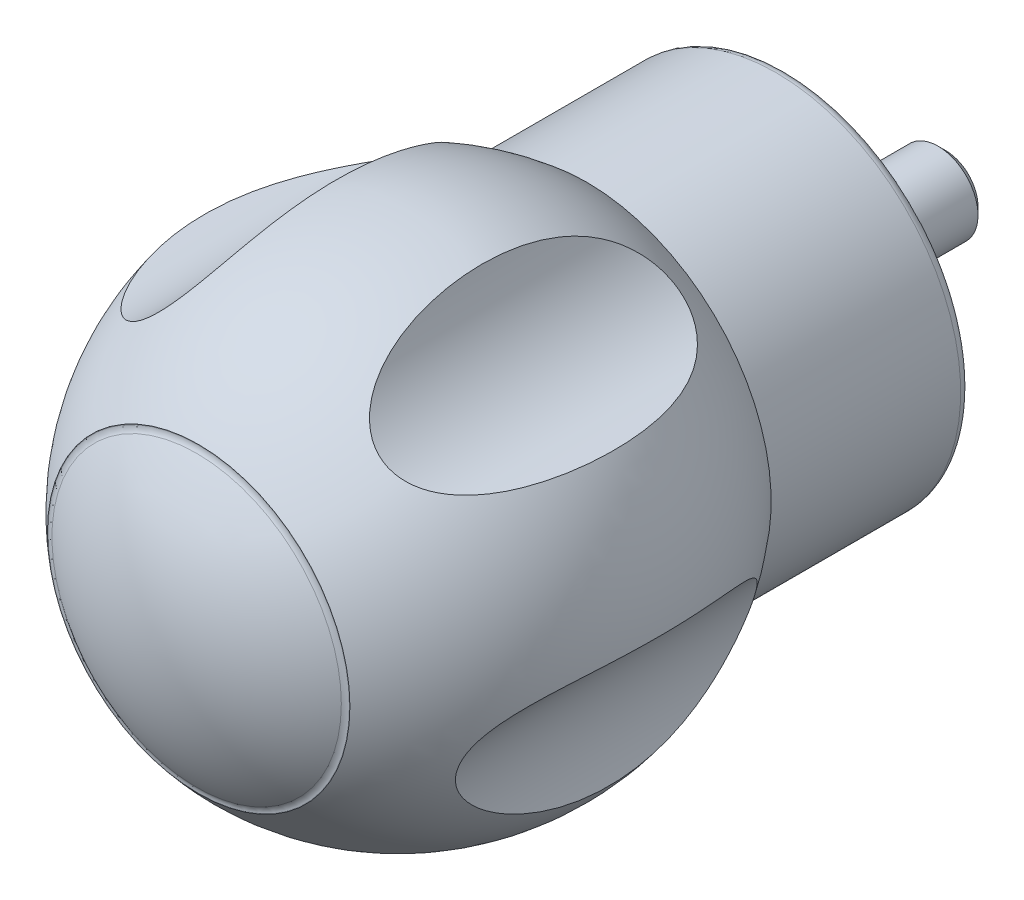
ISO-10303-21;
HEADER;
FILE_DESCRIPTION(('STEP AP214'),'2;1');
FILE_NAME('part.step','',(''),(''),'','','');
FILE_SCHEMA(('AUTOMOTIVE_DESIGN { 1 0 10303 214 1 1 1 1 }'));
ENDSEC;
DATA;
#1=APPLICATION_CONTEXT('core data for automotive mechanical design processes');
#2=APPLICATION_PROTOCOL_DEFINITION('international standard','automotive_design',2000,#1);
#3=PRODUCT_CONTEXT('',#1,'mechanical');
#4=PRODUCT('Part','Part','',(#3));
#5=PRODUCT_RELATED_PRODUCT_CATEGORY('part','',(#4));
#6=PRODUCT_DEFINITION_FORMATION('','',#4);
#7=PRODUCT_DEFINITION_CONTEXT('part definition',#1,'design');
#8=PRODUCT_DEFINITION('design','',#6,#7);
#9=PRODUCT_DEFINITION_SHAPE('','',#8);
#10=(LENGTH_UNIT() NAMED_UNIT(*) SI_UNIT(.MILLI.,.METRE.));
#11=(NAMED_UNIT(*) PLANE_ANGLE_UNIT() SI_UNIT($,.RADIAN.));
#12=(NAMED_UNIT(*) SI_UNIT($,.STERADIAN.) SOLID_ANGLE_UNIT());
#13=UNCERTAINTY_MEASURE_WITH_UNIT(LENGTH_MEASURE(1.E-05),#10,'distance_accuracy_value','');
#14=(GEOMETRIC_REPRESENTATION_CONTEXT(3) GLOBAL_UNCERTAINTY_ASSIGNED_CONTEXT((#13)) GLOBAL_UNIT_ASSIGNED_CONTEXT((#10,
#11,#12)) REPRESENTATION_CONTEXT('',''));
#15=CARTESIAN_POINT('',(0.,0.,0.));
#16=DIRECTION('',(0.,0.,1.));
#17=DIRECTION('',(1.,0.,0.));
#18=AXIS2_PLACEMENT_3D('',#15,#16,#17);
#19=CARTESIAN_POINT('',(0.,0.,0.));
#20=DIRECTION('',(0.,0.,-1.));
#21=DIRECTION('',(0.,1.,0.));
#22=AXIS2_PLACEMENT_3D('',#19,#20,#21);
#23=PLANE('',#22);
#24=CARTESIAN_POINT('',(0.,0.,0.));
#25=DIRECTION('',(0.,0.,-1.));
#26=DIRECTION('',(0.,1.,0.));
#27=AXIS2_PLACEMENT_3D('',#24,#25,#26);
#28=CIRCLE('',#27,4.);
#29=CARTESIAN_POINT('',(0.,4.,0.));
#30=VERTEX_POINT('',#29);
#31=EDGE_CURVE('E8',#30,#30,#28,.T.);
#32=ORIENTED_EDGE('',*,*,#31,.F.);
#33=EDGE_LOOP('',(#32));
#34=FACE_BOUND('',#33,.T.);
#35=CARTESIAN_POINT('',(0.,0.,0.));
#36=DIRECTION('',(0.,0.,-1.));
#37=DIRECTION('',(0.,1.,0.));
#38=AXIS2_PLACEMENT_3D('',#35,#36,#37);
#39=CIRCLE('',#38,17.5);
#40=CARTESIAN_POINT('',(0.,17.5,0.));
#41=VERTEX_POINT('',#40);
#42=EDGE_CURVE('E18',#41,#41,#39,.T.);
#43=ORIENTED_EDGE('',*,*,#42,.T.);
#44=EDGE_LOOP('',(#43));
#45=FACE_BOUND('',#44,.T.);
#46=ADVANCED_FACE('F12',(#34,#45),#23,.T.);
#47=CARTESIAN_POINT('',(0.,0.,0.999999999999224));
#48=DIRECTION('',(0.,0.,-1.));
#49=DIRECTION('',(0.,1.,0.));
#50=AXIS2_PLACEMENT_3D('',#47,#48,#49);
#51=TOROIDAL_SURFACE('',#50,17.5000000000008,0.999999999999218);
#52=CARTESIAN_POINT('',(0.,0.,1.));
#53=DIRECTION('',(0.,0.,-1.));
#54=DIRECTION('',(0.,1.,0.));
#55=AXIS2_PLACEMENT_3D('',#52,#53,#54);
#56=CIRCLE('',#55,18.5);
#57=CARTESIAN_POINT('',(0.,18.5,1.));
#58=VERTEX_POINT('',#57);
#59=EDGE_CURVE('E22',#58,#58,#56,.T.);
#60=ORIENTED_EDGE('',*,*,#59,.T.);
#61=EDGE_LOOP('',(#60));
#62=FACE_BOUND('',#61,.T.);
#63=ORIENTED_EDGE('',*,*,#42,.F.);
#64=EDGE_LOOP('',(#63));
#65=FACE_BOUND('',#64,.T.);
#66=ADVANCED_FACE('F120',(#62,#65),#51,.T.);
#67=CARTESIAN_POINT('',(0.,0.,64.));
#68=DIRECTION('',(0.,0.,-1.));
#69=DIRECTION('',(0.,1.,0.));
#70=AXIS2_PLACEMENT_3D('',#67,#68,#69);
#71=CYLINDRICAL_SURFACE('',#70,18.5);
#72=CARTESIAN_POINT('',(0.,0.,20.));
#73=DIRECTION('',(0.,0.,-1.));
#74=DIRECTION('',(0.,1.,0.));
#75=AXIS2_PLACEMENT_3D('',#72,#73,#74);
#76=CIRCLE('',#75,18.5);
#77=CARTESIAN_POINT('',(0.,18.5,20.));
#78=VERTEX_POINT('',#77);
#79=EDGE_CURVE('E27',#78,#78,#76,.T.);
#80=ORIENTED_EDGE('',*,*,#79,.T.);
#81=EDGE_LOOP('',(#80));
#82=FACE_BOUND('',#81,.T.);
#83=ORIENTED_EDGE('',*,*,#59,.F.);
#84=EDGE_LOOP('',(#83));
#85=FACE_BOUND('',#84,.T.);
#86=ADVANCED_FACE('F106',(#82,#85),#71,.T.);
#87=CARTESIAN_POINT('',(0.,0.,37.7823040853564));
#88=DIRECTION('',(0.,0.,-1.));
#89=DIRECTION('',(0.,1.,0.));
#90=AXIS2_PLACEMENT_3D('',#87,#88,#89);
#91=DEGENERATE_TOROIDAL_SURFACE('',#90,2.45981194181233,27.4867978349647,.F.);
#92=CARTESIAN_POINT('',(9.64615552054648,19.1331819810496,24.1833184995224));
#93=CARTESIAN_POINT('',(9.48345657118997,19.3402419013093,24.3794324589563));
#94=CARTESIAN_POINT('',(9.3348650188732,19.5426746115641,24.5920665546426));
#95=CARTESIAN_POINT('',(9.06234425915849,19.9357170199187,25.0428562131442));
#96=CARTESIAN_POINT('',(8.93845436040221,20.1263075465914,25.2810515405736));
#97=CARTESIAN_POINT('',(8.71118421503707,20.4952338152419,25.7786146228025));
#98=CARTESIAN_POINT('',(8.60794571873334,20.6734797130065,26.0381125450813));
#99=CARTESIAN_POINT('',(8.41968766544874,21.0155888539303,26.5724184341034));
#100=CARTESIAN_POINT('',(8.33466135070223,21.1794574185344,26.8472206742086));
#101=CARTESIAN_POINT('',(8.14928092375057,21.5544472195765,27.5198032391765));
#102=CARTESIAN_POINT('',(8.05609382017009,21.7587365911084,27.9233650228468));
#103=CARTESIAN_POINT('',(7.89274210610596,22.1392008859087,28.7480367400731));
#104=CARTESIAN_POINT('',(7.8225900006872,22.3153605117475,29.1691560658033));
#105=CARTESIAN_POINT('',(7.70040655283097,22.6396177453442,30.023843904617));
#106=CARTESIAN_POINT('',(7.64835011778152,22.787754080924,30.4573942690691));
#107=CARTESIAN_POINT('',(7.5583515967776,23.0566849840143,31.3342431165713));
#108=CARTESIAN_POINT('',(7.52040841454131,23.1774816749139,31.7775408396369));
#109=CARTESIAN_POINT('',(7.46554169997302,23.359526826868,32.5355594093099));
#110=CARTESIAN_POINT('',(7.44573424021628,23.4277178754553,32.8484350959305));
#111=CARTESIAN_POINT('',(7.41078752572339,23.5511669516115,33.4770140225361));
#112=CARTESIAN_POINT('',(7.39564860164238,23.6064240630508,33.7927174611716));
#113=CARTESIAN_POINT('',(7.36943118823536,23.7041033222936,34.4263549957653));
#114=CARTESIAN_POINT('',(7.35835379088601,23.7465220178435,34.744289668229));
#115=CARTESIAN_POINT('',(7.33982062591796,23.8185798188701,35.3817210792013));
#116=CARTESIAN_POINT('',(7.3323652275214,23.8482176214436,35.7012179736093));
#117=CARTESIAN_POINT('',(7.31489793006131,23.9181580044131,36.662895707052));
#118=CARTESIAN_POINT('',(7.30984724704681,23.9392423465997,37.3066647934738));
#119=CARTESIAN_POINT('',(7.31201499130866,23.930357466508,38.5937099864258));
#120=CARTESIAN_POINT('',(7.3192310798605,23.9003979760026,39.2369861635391));
#121=CARTESIAN_POINT('',(7.34031673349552,23.8167327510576,40.2018959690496));
#122=CARTESIAN_POINT('',(7.34913632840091,23.7820772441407,40.5253890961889));
#123=CARTESIAN_POINT('',(7.37065082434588,23.6995982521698,41.1705501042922));
#124=CARTESIAN_POINT('',(7.38334530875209,23.6517761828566,41.4922181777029));
#125=CARTESIAN_POINT('',(7.41313830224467,23.5428498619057,42.1332804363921));
#126=CARTESIAN_POINT('',(7.4302392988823,23.4817381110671,42.4526732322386));
#127=CARTESIAN_POINT('',(7.46953672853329,23.346142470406,43.0882937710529));
#128=CARTESIAN_POINT('',(7.49173305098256,23.2716588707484,43.4045215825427));
#129=CARTESIAN_POINT('',(7.54196498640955,23.1096128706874,44.0313942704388));
#130=CARTESIAN_POINT('',(7.56996980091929,23.0221201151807,44.3420595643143));
#131=CARTESIAN_POINT('',(7.63295092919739,22.8336259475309,44.9585946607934));
#132=CARTESIAN_POINT('',(7.66792784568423,22.7326233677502,45.2644640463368));
#133=CARTESIAN_POINT('',(7.74609493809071,22.5170918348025,45.8699523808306));
#134=CARTESIAN_POINT('',(7.78927572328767,22.4025784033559,46.1695780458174));
#135=CARTESIAN_POINT('',(7.88540878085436,22.1598219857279,46.7615525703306));
#136=CARTESIAN_POINT('',(7.93835812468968,22.0315831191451,47.0539035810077));
#137=CARTESIAN_POINT('',(8.04334062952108,21.7901126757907,47.568273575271));
#138=CARTESIAN_POINT('',(8.09315689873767,21.6795205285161,47.7919850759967));
#139=CARTESIAN_POINT('',(8.2010375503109,21.4497580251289,48.2329104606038));
#140=CARTESIAN_POINT('',(8.25910080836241,21.3305888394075,48.4501252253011));
#141=CARTESIAN_POINT('',(8.3847913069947,21.0834789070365,48.8772303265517));
#142=CARTESIAN_POINT('',(8.45243513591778,20.9555231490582,49.0871071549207));
#143=CARTESIAN_POINT('',(8.59858161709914,20.6911498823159,49.4975980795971));
#144=CARTESIAN_POINT('',(8.67708445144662,20.5547322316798,49.6982120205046));
#145=CARTESIAN_POINT('',(8.84769419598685,20.2716944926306,50.0910311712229));
#146=CARTESIAN_POINT('',(8.93998001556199,20.1249561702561,50.283074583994));
#147=CARTESIAN_POINT('',(9.13905119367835,19.8235620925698,50.6531080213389));
#148=CARTESIAN_POINT('',(9.24584025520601,19.6689043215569,50.831094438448));
#149=CARTESIAN_POINT('',(9.47526528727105,19.3532201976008,51.1690858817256));
#150=CARTESIAN_POINT('',(9.5978411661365,19.1922195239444,51.3291549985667));
#151=CARTESIAN_POINT('',(9.86055062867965,18.8650643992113,51.6279005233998));
#152=CARTESIAN_POINT('',(10.0006666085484,18.698915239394,51.7665980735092));
#153=CARTESIAN_POINT('',(10.3189452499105,18.3420469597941,52.034220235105));
#154=CARTESIAN_POINT('',(10.4996818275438,18.1509018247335,52.1596296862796));
#155=CARTESIAN_POINT('',(10.7882432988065,17.8653559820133,52.3173260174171));
#156=CARTESIAN_POINT('',(10.8873535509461,17.7703573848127,52.3648259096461));
#157=CARTESIAN_POINT('',(11.0911138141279,17.5814933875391,52.4488653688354));
#158=CARTESIAN_POINT('',(11.1957612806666,17.4876274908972,52.4854099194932));
#159=CARTESIAN_POINT('',(11.4109272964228,17.3011546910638,52.547029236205));
#160=CARTESIAN_POINT('',(11.5214842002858,17.2085626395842,52.5720153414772));
#161=CARTESIAN_POINT('',(11.7469624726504,17.0262974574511,52.6095383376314));
#162=CARTESIAN_POINT('',(11.8618819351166,16.9366230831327,52.6220806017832));
#163=CARTESIAN_POINT('',(12.0952129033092,16.7610112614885,52.6344332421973));
#164=CARTESIAN_POINT('',(12.213624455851,16.675073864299,52.6342434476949));
#165=CARTESIAN_POINT('',(12.4528872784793,16.5076976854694,52.6211364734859));
#166=CARTESIAN_POINT('',(12.5737384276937,16.4262586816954,52.6082199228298));
#167=CARTESIAN_POINT('',(12.8055938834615,16.2757414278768,52.5717303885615));
#168=CARTESIAN_POINT('',(12.9164810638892,16.2062153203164,52.5492472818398));
#169=CARTESIAN_POINT('',(13.1385793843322,16.0716588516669,52.4944712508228));
#170=CARTESIAN_POINT('',(13.2497906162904,16.0066299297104,52.4621752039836));
#171=CARTESIAN_POINT('',(13.5827295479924,15.8186232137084,52.3513785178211));
#172=CARTESIAN_POINT('',(13.8038861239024,15.7026457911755,52.2589490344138));
#173=CARTESIAN_POINT('',(14.320248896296,15.450110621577,52.0022092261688));
#174=CARTESIAN_POINT('',(14.6125049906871,15.3218679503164,51.8239538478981));
#175=CARTESIAN_POINT('',(15.1772253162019,15.0968616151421,51.4218619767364));
#176=CARTESIAN_POINT('',(15.4496457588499,15.0001660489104,51.1979285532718));
#177=CARTESIAN_POINT('',(15.9069492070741,14.8535028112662,50.7756127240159));
#178=CARTESIAN_POINT('',(16.0968863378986,14.7978916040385,50.5844859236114));
#179=CARTESIAN_POINT('',(16.4633333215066,14.699129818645,50.1866432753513));
#180=CARTESIAN_POINT('',(16.6398361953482,14.6559856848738,49.9799194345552));
#181=CARTESIAN_POINT('',(16.9795964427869,14.5800076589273,49.5536597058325));
#182=CARTESIAN_POINT('',(17.1428342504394,14.5471887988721,49.3341056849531));
#183=CARTESIAN_POINT('',(17.4561371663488,14.4900636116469,48.8846930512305));
#184=CARTESIAN_POINT('',(17.6061977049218,14.465760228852,48.6548309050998));
#185=CARTESIAN_POINT('',(17.9868742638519,14.4104834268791,48.0345307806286));
#186=CARTESIAN_POINT('',(18.2064910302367,14.3854339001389,47.6367866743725));
#187=CARTESIAN_POINT('',(18.6128643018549,14.3481661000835,46.824233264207));
#188=CARTESIAN_POINT('',(18.7996003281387,14.3359557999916,46.4094135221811));
#189=CARTESIAN_POINT('',(19.1421520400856,14.3198933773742,45.5664949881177));
#190=CARTESIAN_POINT('',(19.2979273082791,14.3160521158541,45.1383796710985));
#191=CARTESIAN_POINT('',(19.5797908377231,14.3133116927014,44.2725635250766));
#192=CARTESIAN_POINT('',(19.7058818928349,14.3144120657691,43.8348636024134));
#193=CARTESIAN_POINT('',(19.8965253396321,14.3182934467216,43.0829226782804));
#194=CARTESIAN_POINT('',(19.9682474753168,14.3204809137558,42.7704677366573));
#195=CARTESIAN_POINT('',(20.0979520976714,14.3253342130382,42.1426951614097));
#196=CARTESIAN_POINT('',(20.1559336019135,14.3280000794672,41.8273773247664));
#197=CARTESIAN_POINT('',(20.2584423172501,14.3332555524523,41.1944730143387));
#198=CARTESIAN_POINT('',(20.3029657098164,14.3358451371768,40.8768859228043));
#199=CARTESIAN_POINT('',(20.3787485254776,14.3405408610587,40.2401174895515));
#200=CARTESIAN_POINT('',(20.4100065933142,14.3426469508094,39.9209359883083));
#201=CARTESIAN_POINT('',(20.4842130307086,14.3477811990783,38.9605812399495));
#202=CARTESIAN_POINT('',(20.5074047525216,14.3496131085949,38.3177751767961));
#203=CARTESIAN_POINT('',(20.5015908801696,14.3491769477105,37.0325236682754));
#204=CARTESIAN_POINT('',(20.4725953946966,14.3469096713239,36.3900781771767));
#205=CARTESIAN_POINT('',(20.3892363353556,14.3412565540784,35.4261568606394));
#206=CARTESIAN_POINT('',(20.3544771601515,14.33897637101,35.1028822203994));
#207=CARTESIAN_POINT('',(20.2712780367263,14.3340068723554,34.4581139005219));
#208=CARTESIAN_POINT('',(20.2228395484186,14.331317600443,34.1366200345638));
#209=CARTESIAN_POINT('',(20.1120162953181,14.3259866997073,33.4958601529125));
#210=CARTESIAN_POINT('',(20.0496237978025,14.3233450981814,33.1765954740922));
#211=CARTESIAN_POINT('',(19.9105983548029,14.3187268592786,32.5411744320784));
#212=CARTESIAN_POINT('',(19.8339657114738,14.3167502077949,32.2250180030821));
#213=CARTESIAN_POINT('',(19.6664947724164,14.3142459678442,31.59816542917));
#214=CARTESIAN_POINT('',(19.5757293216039,14.3137111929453,31.2874499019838));
#215=CARTESIAN_POINT('',(19.3792557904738,14.3150195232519,30.6707388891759));
#216=CARTESIAN_POINT('',(19.2735464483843,14.3168628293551,30.364743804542));
#217=CARTESIAN_POINT('',(19.0467867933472,14.3240841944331,29.7589039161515));
#218=CARTESIAN_POINT('',(18.9257536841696,14.3294583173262,29.4590526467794));
#219=CARTESIAN_POINT('',(18.667680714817,14.3451379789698,28.866510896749));
#220=CARTESIAN_POINT('',(18.5306455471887,14.3554420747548,28.5738183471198));
#221=CARTESIAN_POINT('',(18.2698206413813,14.3798794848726,28.0565192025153));
#222=CARTESIAN_POINT('',(18.1491118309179,14.3927877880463,27.8303006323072));
#223=CARTESIAN_POINT('',(17.8968255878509,14.4237999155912,27.3843837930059));
#224=CARTESIAN_POINT('',(17.7652496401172,14.4419030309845,27.1646846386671));
#225=CARTESIAN_POINT('',(17.4906228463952,14.4845139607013,26.7326331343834));
#226=CARTESIAN_POINT('',(17.3475519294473,14.5090331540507,26.5202946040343));
#227=CARTESIAN_POINT('',(17.0498212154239,14.5658261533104,26.1049313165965));
#228=CARTESIAN_POINT('',(16.8951612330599,14.5981000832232,25.9019067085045));
#229=CARTESIAN_POINT('',(16.5716975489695,14.6725075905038,25.5042749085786));
#230=CARTESIAN_POINT('',(16.4027212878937,14.7147773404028,25.3098324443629));
#231=CARTESIAN_POINT('',(16.0525323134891,14.8107759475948,24.9351177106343));
#232=CARTESIAN_POINT('',(15.8713163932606,14.8645078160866,24.7548491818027));
#233=CARTESIAN_POINT('',(15.4977153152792,14.9852344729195,24.4124922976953));
#234=CARTESIAN_POINT('',(15.3053750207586,15.0521783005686,24.2503377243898));
#235=CARTESIAN_POINT('',(14.9101396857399,15.2013886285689,23.9476798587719));
#236=CARTESIAN_POINT('',(14.7072556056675,15.2836394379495,23.8071546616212));
#237=CARTESIAN_POINT('',(14.2677894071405,15.4762585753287,23.5371657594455));
#238=CARTESIAN_POINT('',(14.0300690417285,15.5888074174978,23.4110046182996));
#239=CARTESIAN_POINT('',(13.6691228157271,15.7746252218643,23.2521491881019));
#240=CARTESIAN_POINT('',(13.5480644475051,15.839406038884,23.204257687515));
#241=CARTESIAN_POINT('',(13.3052834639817,15.9746013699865,23.1194301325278));
#242=CARTESIAN_POINT('',(13.1835611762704,16.0450133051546,23.0824890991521));
#243=CARTESIAN_POINT('',(12.9394612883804,16.1918335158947,23.0200747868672));
#244=CARTESIAN_POINT('',(12.8170857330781,16.2682832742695,22.9946907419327));
#245=CARTESIAN_POINT('',(12.5737336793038,16.4262595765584,22.9563831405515));
#246=CARTESIAN_POINT('',(12.4527565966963,16.5077839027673,22.9434541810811));
#247=CARTESIAN_POINT('',(12.2132400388,16.6753479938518,22.9303540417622));
#248=CARTESIAN_POINT('',(12.0947006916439,16.761387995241,22.9301835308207));
#249=CARTESIAN_POINT('',(11.8611503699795,16.937182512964,22.9425849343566));
#250=CARTESIAN_POINT('',(11.7461391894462,17.026936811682,22.955156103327));
#251=CARTESIAN_POINT('',(11.4286566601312,17.2836473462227,23.0081332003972));
#252=CARTESIAN_POINT('',(11.2311540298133,17.4540059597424,23.0628637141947));
#253=CARTESIAN_POINT('',(10.8547688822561,17.798819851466,23.2095558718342));
#254=CARTESIAN_POINT('',(10.6758911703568,17.9732761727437,23.3015270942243));
#255=CARTESIAN_POINT('',(10.3454340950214,18.3141897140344,23.5125503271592));
#256=CARTESIAN_POINT('',(10.1930118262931,18.4806684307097,23.6302683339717));
#257=CARTESIAN_POINT('',(9.9063000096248,18.8100812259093,23.8898050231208));
#258=CARTESIAN_POINT('',(9.77200724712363,18.9730159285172,24.0316194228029));
#259=CARTESIAN_POINT('',(9.64615552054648,19.1331819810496,24.1833184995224));
#260=B_SPLINE_CURVE_WITH_KNOTS('',3,(#92,#93,#94,#95,#96,#97,#98,#99,#100,#101,#102,#103,#104,
#105,#106,#107,#108,#109,#110,#111,#112,#113,#114,#115,#116,#117,#118,#119,#120,#121,#122,#123,
#124,#125,#126,#127,#128,#129,#130,#131,#132,#133,#134,#135,#136,#137,#138,#139,#140,#141,#142,
#143,#144,#145,#146,#147,#148,#149,#150,#151,#152,#153,#154,#155,#156,#157,#158,#159,#160,#161,
#162,#163,#164,#165,#166,#167,#168,#169,#170,#171,#172,#173,#174,#175,#176,#177,#178,#179,#180,
#181,#182,#183,#184,#185,#186,#187,#188,#189,#190,#191,#192,#193,#194,#195,#196,#197,#198,#199,
#200,#201,#202,#203,#204,#205,#206,#207,#208,#209,#210,#211,#212,#213,#214,#215,#216,#217,#218,
#219,#220,#221,#222,#223,#224,#225,#226,#227,#228,#229,#230,#231,#232,#233,#234,#235,#236,#237,
#238,#239,#240,#241,#242,#243,#244,#245,#246,#247,#248,#249,#250,#251,#252,#253,#254,#255,#256,
#257,#258,#259),.UNSPECIFIED.,.T.,.F.,(4,2,2,2,2,2,2,2,2,2,2,2,2,2,2,2,2,2,2,2,2,2,2,2,2,2,2,2,
2,2,2,2,2,2,2,2,2,2,2,2,2,2,2,2,2,2,2,2,2,2,2,2,2,2,2,2,2,2,2,2,2,2,2,2,2,2,2,2,2,2,2,2,2,2,2,2,
2,2,2,2,2,2,2,4),(0.,0.984470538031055,1.97049541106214,2.96307211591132,3.95527987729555,
5.33855218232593,6.72257419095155,8.10466929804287,9.4866570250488,10.4488665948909,
11.4111442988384,12.3736805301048,13.3363148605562,15.2664246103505,17.1961664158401,
18.1723123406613,19.1483533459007,20.1249465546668,21.1015185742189,22.07303913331,
23.0446437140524,24.0151427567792,24.9853513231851,25.7484674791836,26.5114796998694,
27.2758295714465,28.0401922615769,28.8155138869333,29.5910338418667,30.3636845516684,
31.1355659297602,32.0061083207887,32.4414898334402,32.8766729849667,33.3151410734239,
33.7534197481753,34.1917043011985,34.6299671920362,35.0279045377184,35.4259686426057,
36.2216565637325,37.3123882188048,38.4054589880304,39.22976871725,40.0545037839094,
40.8804340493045,41.7066496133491,43.0696147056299,44.4334257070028,45.7990055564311,
47.1644568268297,48.1259320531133,49.0874760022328,50.0492925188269,51.0112072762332,
52.9386033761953,54.8656261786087,55.8408202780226,56.815910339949,57.7915421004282,
58.7671531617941,59.7378926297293,60.7087141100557,61.678455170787,62.6479125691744,
63.417790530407,64.1875634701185,64.9587109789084,65.7298708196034,66.5122118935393,
67.2947587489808,68.0743441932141,68.8531348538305,69.7245362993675,70.1603455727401,
70.5959563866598,71.0348758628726,71.4736048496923,71.9123568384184,72.3510831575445,
73.1467362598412,73.9425941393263,74.7042420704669,75.4657547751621),.UNSPECIFIED.);
#261=CARTESIAN_POINT('',(9.64615552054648,19.1331819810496,24.1833184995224));
#262=VERTEX_POINT('',#261);
#263=EDGE_CURVE('E83',#262,#262,#260,.T.);
#264=ORIENTED_EDGE('',*,*,#263,.F.);
#265=EDGE_LOOP('',(#264));
#266=FACE_BOUND('',#265,.T.);
#267=CARTESIAN_POINT('',(19.0721852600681,-11.1680952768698,25.4426161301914));
#268=CARTESIAN_POINT('',(19.0623640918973,-11.0283355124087,25.2851801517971));
#269=CARTESIAN_POINT('',(19.0545384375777,-10.8837357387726,25.1318868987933));
#270=CARTESIAN_POINT('',(19.0438547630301,-10.5846503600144,24.8351316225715));
#271=CARTESIAN_POINT('',(19.0409972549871,-10.4301637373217,24.691670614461));
#272=CARTESIAN_POINT('',(19.0415090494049,-9.95209015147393,24.2791378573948));
#273=CARTESIAN_POINT('',(19.0538954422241,-9.61310588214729,24.0270115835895));
#274=CARTESIAN_POINT('',(19.1041865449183,-8.99900634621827,23.6497700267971));
#275=CARTESIAN_POINT('',(19.1338737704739,-8.73297996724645,23.5089050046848));
#276=CARTESIAN_POINT('',(19.1938752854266,-8.32262867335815,23.3287295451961));
#277=CARTESIAN_POINT('',(19.2164603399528,-8.18393056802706,23.2738501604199));
#278=CARTESIAN_POINT('',(19.267080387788,-7.90355872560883,23.1754616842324));
#279=CARTESIAN_POINT('',(19.2951129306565,-7.76188635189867,23.1319475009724));
#280=CARTESIAN_POINT('',(19.357082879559,-7.47527231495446,23.0568566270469));
#281=CARTESIAN_POINT('',(19.3910701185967,-7.33031284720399,23.0253884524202));
#282=CARTESIAN_POINT('',(19.4647864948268,-7.03957276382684,22.9756795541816));
#283=CARTESIAN_POINT('',(19.5045155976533,-6.89379215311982,22.9574387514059));
#284=CARTESIAN_POINT('',(19.5895057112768,-6.60284514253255,22.9346551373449));
#285=CARTESIAN_POINT('',(19.6347640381,-6.45767847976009,22.9301057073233));
#286=CARTESIAN_POINT('',(19.7304375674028,-6.16929121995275,22.9348062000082));
#287=CARTESIAN_POINT('',(19.780852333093,-6.02607045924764,22.9440549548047));
#288=CARTESIAN_POINT('',(19.8798541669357,-5.76014382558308,22.9741532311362));
#289=CARTESIAN_POINT('',(19.9279160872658,-5.63706374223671,22.9934527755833));
#290=CARTESIAN_POINT('',(20.0271323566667,-5.39416709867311,23.0421227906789));
#291=CARTESIAN_POINT('',(20.0782876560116,-5.27435155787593,23.0714963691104));
#292=CARTESIAN_POINT('',(20.2356369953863,-4.92085237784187,23.1739727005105));
#293=CARTESIAN_POINT('',(20.3457684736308,-4.6929725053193,23.2614481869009));
#294=CARTESIAN_POINT('',(20.6101862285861,-4.18352994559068,23.5040625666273));
#295=CARTESIAN_POINT('',(20.7669386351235,-3.90944430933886,23.6720412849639));
#296=CARTESIAN_POINT('',(21.0837421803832,-3.39692062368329,24.0533196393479));
#297=CARTESIAN_POINT('',(21.2437993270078,-3.15855548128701,24.266709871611));
#298=CARTESIAN_POINT('',(21.5210545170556,-2.77180192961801,24.6689738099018));
#299=CARTESIAN_POINT('',(21.6388543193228,-2.61590410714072,24.8503989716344));
#300=CARTESIAN_POINT('',(21.8714595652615,-2.32137372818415,25.2286598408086));
#301=CARTESIAN_POINT('',(21.9862634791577,-2.18274986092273,25.4255032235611));
#302=CARTESIAN_POINT('',(22.2117703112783,-1.92107852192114,25.8319054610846));
#303=CARTESIAN_POINT('',(22.3224670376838,-1.79805394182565,26.0414823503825));
#304=CARTESIAN_POINT('',(22.538766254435,-1.5662031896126,26.4709068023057));
#305=CARTESIAN_POINT('',(22.6443669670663,-1.45738195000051,26.6907578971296));
#306=CARTESIAN_POINT('',(22.9164150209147,-1.18608106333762,27.2841896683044));
#307=CARTESIAN_POINT('',(23.0779389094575,-1.03453662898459,27.6650536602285));
#308=CARTESIAN_POINT('',(23.3834716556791,-0.76045920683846,28.4439005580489));
#309=CARTESIAN_POINT('',(23.5274695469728,-0.637944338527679,28.8418939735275));
#310=CARTESIAN_POINT('',(23.7968925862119,-0.417328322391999,29.6513113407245));
#311=CARTESIAN_POINT('',(23.9222912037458,-0.31926191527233,30.0627534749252));
#312=CARTESIAN_POINT('',(24.1534746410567,-0.144173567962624,30.8954130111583));
#313=CARTESIAN_POINT('',(24.2592612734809,-0.0671496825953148,31.3166295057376));
#314=CARTESIAN_POINT('',(24.4238467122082,0.0496019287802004,32.047227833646));
#315=CARTESIAN_POINT('',(24.4875023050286,0.0937309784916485,32.3548380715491));
#316=CARTESIAN_POINT('',(24.6042630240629,0.173368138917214,32.973190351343));
#317=CARTESIAN_POINT('',(24.6573673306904,0.208875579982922,33.2839326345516));
#318=CARTESIAN_POINT('',(24.7529207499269,0.271939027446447,33.9079408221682));
#319=CARTESIAN_POINT('',(24.7953666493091,0.29949263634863,34.2212074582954));
#320=CARTESIAN_POINT('',(24.8695059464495,0.347151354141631,34.849603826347));
#321=CARTESIAN_POINT('',(24.9011982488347,0.367255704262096,35.1647337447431));
#322=CARTESIAN_POINT('',(24.9538094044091,0.4004149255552,35.7967783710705));
#323=CARTESIAN_POINT('',(24.9747105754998,0.41345822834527,36.1136951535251));
#324=CARTESIAN_POINT('',(25.0056258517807,0.432690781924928,36.7482953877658));
#325=CARTESIAN_POINT('',(25.0156389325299,0.438879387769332,37.0659789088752));
#326=CARTESIAN_POINT('',(25.0247561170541,0.444515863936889,37.701486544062));
#327=CARTESIAN_POINT('',(25.0238628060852,0.443965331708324,38.0193106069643));
#328=CARTESIAN_POINT('',(25.0111750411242,0.436117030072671,38.6546576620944));
#329=CARTESIAN_POINT('',(24.9993805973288,0.4288192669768,38.9721806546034));
#330=CARTESIAN_POINT('',(24.9646664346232,0.407187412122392,39.6109021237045));
#331=CARTESIAN_POINT('',(24.9415913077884,0.392754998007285,39.9320888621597));
#332=CARTESIAN_POINT('',(24.8842948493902,0.35653347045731,40.5730139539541));
#333=CARTESIAN_POINT('',(24.8500748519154,0.334745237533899,40.8927524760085));
#334=CARTESIAN_POINT('',(24.770531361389,0.28337778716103,41.5303953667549));
#335=CARTESIAN_POINT('',(24.7252019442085,0.253794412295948,41.8482986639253));
#336=CARTESIAN_POINT('',(24.6235459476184,0.186275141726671,42.4814152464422));
#337=CARTESIAN_POINT('',(24.5672207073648,0.148340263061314,42.7966288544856));
#338=CARTESIAN_POINT('',(24.4439137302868,0.0635358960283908,43.4225619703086));
#339=CARTESIAN_POINT('',(24.3769710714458,0.0166990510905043,43.7332935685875));
#340=CARTESIAN_POINT('',(24.2324546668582,-0.0868896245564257,44.3505654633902));
#341=CARTESIAN_POINT('',(24.154882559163,-0.143639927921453,44.657106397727));
#342=CARTESIAN_POINT('',(23.9893767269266,-0.268104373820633,45.264857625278));
#343=CARTESIAN_POINT('',(23.9014515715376,-0.335809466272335,45.5660720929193));
#344=CARTESIAN_POINT('',(23.7154832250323,-0.483512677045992,46.1622480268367));
#345=CARTESIAN_POINT('',(23.6174424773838,-0.563507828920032,46.45721098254));
#346=CARTESIAN_POINT('',(23.4257259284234,-0.725434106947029,46.9996108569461));
#347=CARTESIAN_POINT('',(23.3332965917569,-0.80559397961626,47.248016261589));
#348=CARTESIAN_POINT('',(23.1414992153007,-0.977402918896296,47.738084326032));
#349=CARTESIAN_POINT('',(23.042131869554,-1.0690508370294,47.9797476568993));
#350=CARTESIAN_POINT('',(22.836865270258,-1.2651914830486,48.4550245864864));
#351=CARTESIAN_POINT('',(22.7309652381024,-1.36968574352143,48.6886372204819));
#352=CARTESIAN_POINT('',(22.5132257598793,-1.5930227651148,49.1460594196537));
#353=CARTESIAN_POINT('',(22.4013870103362,-1.71186384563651,49.3698701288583));
#354=CARTESIAN_POINT('',(22.1901963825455,-1.94603320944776,49.771941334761));
#355=CARTESIAN_POINT('',(22.0915743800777,-2.05908329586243,49.9519081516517));
#356=CARTESIAN_POINT('',(21.8912959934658,-2.29775849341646,50.3016081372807));
#357=CARTESIAN_POINT('',(21.7896393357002,-2.42338474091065,50.4713403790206));
#358=CARTESIAN_POINT('',(21.5843567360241,-2.68806499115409,50.7981776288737));
#359=CARTESIAN_POINT('',(21.4807348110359,-2.82709356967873,50.9553055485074));
#360=CARTESIAN_POINT('',(21.2725598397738,-3.11965882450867,51.2546655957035));
#361=CARTESIAN_POINT('',(21.1680069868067,-3.27319254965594,51.3969007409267));
#362=CARTESIAN_POINT('',(20.9242857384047,-3.64993770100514,51.7083703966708));
#363=CARTESIAN_POINT('',(20.7852831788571,-3.87923401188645,51.8706322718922));
#364=CARTESIAN_POINT('',(20.581320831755,-4.24337798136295,52.08338385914));
#365=CARTESIAN_POINT('',(20.5140777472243,-4.36815194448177,52.1492039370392));
#366=CARTESIAN_POINT('',(20.3818256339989,-4.62414700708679,52.2695153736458));
#367=CARTESIAN_POINT('',(20.3168154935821,-4.75536481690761,52.3240124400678));
#368=CARTESIAN_POINT('',(20.1891131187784,-5.02518084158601,52.4211148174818));
#369=CARTESIAN_POINT('',(20.1264539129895,-5.1638439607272,52.4635838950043));
#370=CARTESIAN_POINT('',(20.0050835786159,-5.44625718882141,52.5348095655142));
#371=CARTESIAN_POINT('',(19.9463703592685,-5.5900045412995,52.5635734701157));
#372=CARTESIAN_POINT('',(19.8336837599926,-5.88139098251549,52.6066569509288));
#373=CARTESIAN_POINT('',(19.779707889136,-6.02902797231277,52.6209841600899));
#374=CARTESIAN_POINT('',(19.6771442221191,-6.32683662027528,52.6348208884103));
#375=CARTESIAN_POINT('',(19.6285557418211,-6.47700795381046,52.6343322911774));
#376=CARTESIAN_POINT('',(19.5436532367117,-6.75723229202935,52.6196633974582));
#377=CARTESIAN_POINT('',(19.5065731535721,-6.88715799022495,52.607409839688));
#378=CARTESIAN_POINT('',(19.4369248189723,-7.14678746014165,52.5722284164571));
#379=CARTESIAN_POINT('',(19.4043578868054,-7.27649115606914,52.5492974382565));
#380=CARTESIAN_POINT('',(19.3135579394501,-7.66382691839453,52.4651006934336));
#381=CARTESIAN_POINT('',(19.2621768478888,-7.91984661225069,52.3884218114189));
#382=CARTESIAN_POINT('',(19.1660350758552,-8.48522658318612,52.1749375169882));
#383=CARTESIAN_POINT('',(19.1263358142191,-8.79146523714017,52.027765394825));
#384=CARTESIAN_POINT('',(19.0700867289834,-9.38041135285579,51.6886082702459));
#385=CARTESIAN_POINT('',(19.0535777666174,-9.66307645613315,51.4965448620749));
#386=CARTESIAN_POINT('',(19.0405665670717,-10.1295722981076,51.1346277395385));
#387=CARTESIAN_POINT('',(19.0398828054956,-10.3195626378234,50.9726561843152));
#388=CARTESIAN_POINT('',(19.0462252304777,-10.6856064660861,50.6336861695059));
#389=CARTESIAN_POINT('',(19.0532550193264,-10.8616534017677,50.4566807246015));
#390=CARTESIAN_POINT('',(19.0733427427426,-11.2002791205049,50.0901686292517));
#391=CARTESIAN_POINT('',(19.0864092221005,-11.3628384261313,49.9006445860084));
#392=CARTESIAN_POINT('',(19.117108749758,-11.6748367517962,49.5114023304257));
#393=CARTESIAN_POINT('',(19.1347433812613,-11.8242711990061,49.3116806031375));
#394=CARTESIAN_POINT('',(19.1856441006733,-12.202226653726,48.7733353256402));
#395=CARTESIAN_POINT('',(19.2216949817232,-12.4202162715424,48.4275565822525));
#396=CARTESIAN_POINT('',(19.2981940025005,-12.825499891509,47.7188879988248));
#397=CARTESIAN_POINT('',(19.3386448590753,-13.0127747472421,47.3559876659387));
#398=CARTESIAN_POINT('',(19.4206221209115,-13.35943497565,46.6165314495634));
#399=CARTESIAN_POINT('',(19.4621502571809,-13.5187718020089,46.2399531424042));
#400=CARTESIAN_POINT('',(19.5435868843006,-13.8113796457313,45.4767269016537));
#401=CARTESIAN_POINT('',(19.5834955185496,-13.9446529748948,45.0900798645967));
#402=CARTESIAN_POINT('',(19.6501579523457,-14.1566882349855,44.4066290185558));
#403=CARTESIAN_POINT('',(19.6777064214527,-14.2407488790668,44.1115260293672));
#404=CARTESIAN_POINT('',(19.7300953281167,-14.3958988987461,43.5176637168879));
#405=CARTESIAN_POINT('',(19.7549355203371,-14.4669870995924,43.2189040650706));
#406=CARTESIAN_POINT('',(19.8013565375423,-14.5967402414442,42.6183481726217));
#407=CARTESIAN_POINT('',(19.8229362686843,-14.6554010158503,42.3165509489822));
#408=CARTESIAN_POINT('',(19.8623907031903,-14.7607054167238,41.7106150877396));
#409=CARTESIAN_POINT('',(19.8802650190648,-14.8073477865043,41.4064762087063));
#410=CARTESIAN_POINT('',(19.9277972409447,-14.9298115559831,40.4911627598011));
#411=CARTESIAN_POINT('',(19.9513523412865,-14.9881373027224,39.877243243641));
#412=CARTESIAN_POINT('',(19.980434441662,-15.0598279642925,38.6464982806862));
#413=CARTESIAN_POINT('',(19.98596455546,-15.0732006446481,38.0296733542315));
#414=CARTESIAN_POINT('',(19.9804674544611,-15.059744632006,37.0990523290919));
#415=CARTESIAN_POINT('',(19.9762262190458,-15.0494054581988,36.7848898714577));
#416=CARTESIAN_POINT('',(19.9630675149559,-15.0170456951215,36.1572728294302));
#417=CARTESIAN_POINT('',(19.9541504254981,-14.9950260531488,35.8438181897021));
#418=CARTESIAN_POINT('',(19.9317957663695,-14.9391344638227,35.2180253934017));
#419=CARTESIAN_POINT('',(19.9183566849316,-14.9052585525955,34.9056876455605));
#420=CARTESIAN_POINT('',(19.8872163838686,-14.8254014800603,34.2828052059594));
#421=CARTESIAN_POINT('',(19.8695156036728,-14.7794215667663,33.9722603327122));
#422=CARTESIAN_POINT('',(19.8301819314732,-14.6749485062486,33.3531945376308));
#423=CARTESIAN_POINT('',(19.8085449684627,-14.6164423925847,33.0446760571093));
#424=CARTESIAN_POINT('',(19.7618132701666,-14.4864993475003,32.4306708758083));
#425=CARTESIAN_POINT('',(19.7367189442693,-14.4150639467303,32.1251838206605));
#426=CARTESIAN_POINT('',(19.6836570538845,-14.2587267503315,31.5180455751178));
#427=CARTESIAN_POINT('',(19.6556906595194,-14.1738304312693,31.2163928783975));
#428=CARTESIAN_POINT('',(19.5975967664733,-13.9898887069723,30.6176812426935));
#429=CARTESIAN_POINT('',(19.5674694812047,-13.8908446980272,30.3206218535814));
#430=CARTESIAN_POINT('',(19.4931147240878,-13.633529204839,29.6097093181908));
#431=CARTESIAN_POINT('',(19.4482286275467,-13.4677451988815,29.1985987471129));
#432=CARTESIAN_POINT('',(19.3589486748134,-13.1034501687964,28.3908356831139));
#433=CARTESIAN_POINT('',(19.3145550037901,-12.9049272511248,27.9941885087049));
#434=CARTESIAN_POINT('',(19.2306273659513,-12.4728645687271,27.2220747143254));
#435=CARTESIAN_POINT('',(19.1910708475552,-12.2394995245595,26.8465145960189));
#436=CARTESIAN_POINT('',(19.1394074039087,-11.8602414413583,26.3032059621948));
#437=CARTESIAN_POINT('',(19.1234698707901,-11.7290145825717,26.1255117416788));
#438=CARTESIAN_POINT('',(19.0950168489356,-11.4563347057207,25.7778951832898));
#439=CARTESIAN_POINT('',(19.0825004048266,-11.3148845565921,25.6079706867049));
#440=CARTESIAN_POINT('',(19.0721852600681,-11.1680952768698,25.4426161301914));
#441=B_SPLINE_CURVE_WITH_KNOTS('',3,(#267,#268,#269,#270,#271,#272,#273,#274,#275,#276,#277,
#278,#279,#280,#281,#282,#283,#284,#285,#286,#287,#288,#289,#290,#291,#292,#293,#294,#295,#296,
#297,#298,#299,#300,#301,#302,#303,#304,#305,#306,#307,#308,#309,#310,#311,#312,#313,#314,#315,
#316,#317,#318,#319,#320,#321,#322,#323,#324,#325,#326,#327,#328,#329,#330,#331,#332,#333,#334,
#335,#336,#337,#338,#339,#340,#341,#342,#343,#344,#345,#346,#347,#348,#349,#350,#351,#352,#353,
#354,#355,#356,#357,#358,#359,#360,#361,#362,#363,#364,#365,#366,#367,#368,#369,#370,#371,#372,
#373,#374,#375,#376,#377,#378,#379,#380,#381,#382,#383,#384,#385,#386,#387,#388,#389,#390,#391,
#392,#393,#394,#395,#396,#397,#398,#399,#400,#401,#402,#403,#404,#405,#406,#407,#408,#409,#410,
#411,#412,#413,#414,#415,#416,#417,#418,#419,#420,#421,#422,#423,#424,#425,#426,#427,#428,#429,
#430,#431,#432,#433,#434,#435,#436,#437,#438,#439,#440),.UNSPECIFIED.,.T.,.F.,(4,2,2,2,2,2,2,2,
2,2,2,2,2,2,2,2,2,2,2,2,2,2,2,2,2,2,2,2,2,2,2,2,2,2,2,2,2,2,2,2,2,2,2,2,2,2,2,2,2,2,2,2,2,2,2,2,
2,2,2,2,2,2,2,2,2,2,2,2,2,2,2,2,2,2,2,2,2,2,2,2,2,2,2,2,2,2,4),(0.,0.632111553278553,
1.26428826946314,2.52507796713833,3.42891741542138,3.88101915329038,4.33291799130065,
4.78879696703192,5.24467321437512,5.70032904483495,6.15594630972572,6.55607609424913,
6.95632942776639,7.75637833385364,8.82352779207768,9.89282651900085,10.6916909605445,
11.4909556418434,12.2913799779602,13.0920815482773,14.4117420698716,15.732224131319,
17.0545720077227,18.3767976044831,19.3281410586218,20.2795583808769,21.2312621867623,
22.183062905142,23.1364183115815,24.0898634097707,25.0430825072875,25.9963007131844,
26.9630375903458,27.9296587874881,28.8967965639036,29.8638166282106,30.8273567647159,
31.7907485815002,32.7533485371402,33.7157165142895,34.5460547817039,35.3763101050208,
36.2066645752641,37.0369218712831,37.7393011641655,38.4417439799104,39.1428795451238,
39.8438727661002,40.7802631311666,41.2486393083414,41.7167788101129,42.1900259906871,
42.6630204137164,43.1357646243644,43.6084487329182,44.0149459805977,44.4215618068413,
45.2342888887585,46.2550563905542,47.2776202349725,48.0256360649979,48.7740013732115,
49.5234292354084,50.2731171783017,51.5021937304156,52.732033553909,53.9639896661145,
55.1958364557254,56.1197669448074,57.0437810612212,57.9681044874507,58.8925245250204,
60.741830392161,62.5908167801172,63.5336888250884,64.4764844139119,65.4195955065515,
66.3626093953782,67.3066042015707,68.2504873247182,69.1939874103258,70.1373944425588,
71.4726853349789,72.8084623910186,74.1377530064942,74.8018436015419,75.4657485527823),.UNSPECIFIED.);
#442=CARTESIAN_POINT('',(19.0721852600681,-11.1680952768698,25.4426161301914));
#443=VERTEX_POINT('',#442);
#444=EDGE_CURVE('E78',#443,#443,#441,.T.);
#445=ORIENTED_EDGE('',*,*,#444,.F.);
#446=EDGE_LOOP('',(#445));
#447=FACE_BOUND('',#446,.T.);
#448=CARTESIAN_POINT('',(-4.39828338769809,-21.4619120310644,25.0647607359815));
#449=CARTESIAN_POINT('',(-4.14449352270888,-21.367454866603,24.7898352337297));
#450=CARTESIAN_POINT('',(-3.87234979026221,-21.2754235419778,24.5306716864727));
#451=CARTESIAN_POINT('',(-3.28916050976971,-21.1027408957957,24.0558665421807));
#452=CARTESIAN_POINT('',(-2.97817789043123,-21.022071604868,23.8401559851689));
#453=CARTESIAN_POINT('',(-2.39618792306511,-20.8970859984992,23.511441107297));
#454=CARTESIAN_POINT('',(-2.13308420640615,-20.8486836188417,23.3862121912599));
#455=CARTESIAN_POINT('',(-1.72478466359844,-20.7877529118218,23.2299049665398));
#456=CARTESIAN_POINT('',(-1.58639019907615,-20.7693863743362,23.1830541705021));
#457=CARTESIAN_POINT('',(-1.30578935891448,-20.7369971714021,23.1007222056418));
#458=CARTESIAN_POINT('',(-1.16358469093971,-20.7229725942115,23.0652360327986));
#459=CARTESIAN_POINT('',(-0.875236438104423,-20.6995730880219,23.0061634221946));
#460=CARTESIAN_POINT('',(-0.72907151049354,-20.6902332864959,22.9826668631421));
#461=CARTESIAN_POINT('',(-0.435003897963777,-20.6766460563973,22.9485202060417));
#462=CARTESIAN_POINT('',(-0.287101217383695,-20.672398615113,22.937870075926));
#463=CARTESIAN_POINT('',(0.00909543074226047,-20.6691336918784,22.9296815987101));
#464=CARTESIAN_POINT('',(0.157389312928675,-20.6701151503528,22.9321405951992));
#465=CARTESIAN_POINT('',(0.453048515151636,-20.6772736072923,22.9501025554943));
#466=CARTESIAN_POINT('',(0.600413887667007,-20.6834503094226,22.9656047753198));
#467=CARTESIAN_POINT('',(0.877539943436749,-20.6998880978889,23.006973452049));
#468=CARTESIAN_POINT('',(1.0075211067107,-20.709650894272,23.0315773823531));
#469=CARTESIAN_POINT('',(1.26494567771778,-20.732938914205,23.0904648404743));
#470=CARTESIAN_POINT('',(1.39238828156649,-20.7464653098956,23.1247513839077));
#471=CARTESIAN_POINT('',(1.76979609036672,-20.7922458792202,23.241284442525));
#472=CARTESIAN_POINT('',(2.01499230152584,-20.8297109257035,23.3372278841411));
#473=CARTESIAN_POINT('',(2.58178370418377,-20.9325649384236,23.6040279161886));
#474=CARTESIAN_POINT('',(2.89547736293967,-21.0031408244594,23.789506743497));
#475=CARTESIAN_POINT('',(3.48720697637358,-21.1578890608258,24.2062262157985));
#476=CARTESIAN_POINT('',(3.76516235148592,-21.2420912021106,24.4375673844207));
#477=CARTESIAN_POINT('',(4.22311572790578,-21.3963650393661,24.874007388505));
#478=CARTESIAN_POINT('',(4.4105712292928,-21.4649470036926,25.0719791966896));
#479=CARTESIAN_POINT('',(4.76670581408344,-21.6040763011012,25.4836324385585));
#480=CARTESIAN_POINT('',(4.93537497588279,-21.6746246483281,25.6973220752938));
#481=CARTESIAN_POINT('',(5.25545315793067,-21.8160142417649,26.137580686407));
#482=CARTESIAN_POINT('',(5.40683664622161,-21.8868557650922,26.3641679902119));
#483=CARTESIAN_POINT('',(5.6935353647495,-22.0273909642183,26.8276693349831));
#484=CARTESIAN_POINT('',(5.82884504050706,-22.0970842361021,27.0645869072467));
#485=CARTESIAN_POINT('',(6.16785540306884,-22.2787627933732,27.7035859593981));
#486=CARTESIAN_POINT('',(6.35887773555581,-22.3888085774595,28.112973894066));
#487=CARTESIAN_POINT('',(6.70604465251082,-22.5990750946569,28.9487545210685));
#488=CARTESIAN_POINT('',(6.86216759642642,-22.6992897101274,29.3751575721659));
#489=CARTESIAN_POINT('',(7.14382984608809,-22.8873835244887,30.2411132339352));
#490=CARTESIAN_POINT('',(7.26933185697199,-22.9752476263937,30.6806811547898));
#491=CARTESIAN_POINT('',(7.49283403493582,-23.1366018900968,31.5692511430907));
#492=CARTESIAN_POINT('',(7.59083682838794,-23.2100934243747,32.0182523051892));
#493=CARTESIAN_POINT('',(7.73565724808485,-23.3212237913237,32.7843988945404));
#494=CARTESIAN_POINT('',(7.78895529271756,-23.3629462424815,33.0997580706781));
#495=CARTESIAN_POINT('',(7.88421240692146,-23.4385058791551,33.7331510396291));
#496=CARTESIAN_POINT('',(7.92617071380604,-23.4723425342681,34.0511850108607));
#497=CARTESIAN_POINT('',(7.99926654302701,-23.5318693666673,34.6893333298));
#498=CARTESIAN_POINT('',(8.03040111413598,-23.5575573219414,35.0094482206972));
#499=CARTESIAN_POINT('',(8.08221460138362,-23.6005867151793,35.6511128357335));
#500=CARTESIAN_POINT('',(8.10289245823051,-23.6179273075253,35.9726627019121));
#501=CARTESIAN_POINT('',(8.13407357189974,-23.6441625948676,36.6173353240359));
#502=CARTESIAN_POINT('',(8.1445534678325,-23.6530378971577,36.9404599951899));
#503=CARTESIAN_POINT('',(8.1553834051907,-23.6622106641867,37.5870008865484));
#504=CARTESIAN_POINT('',(8.15573342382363,-23.6625081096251,37.9104171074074));
#505=CARTESIAN_POINT('',(8.14630844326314,-23.6545235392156,38.5569513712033));
#506=CARTESIAN_POINT('',(8.13653485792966,-23.6462427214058,38.8800694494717));
#507=CARTESIAN_POINT('',(8.10674815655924,-23.6211639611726,39.5254653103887));
#508=CARTESIAN_POINT('',(8.08673624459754,-23.6043670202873,39.8477431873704));
#509=CARTESIAN_POINT('',(8.03596337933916,-23.5621558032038,40.4943338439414));
#510=CARTESIAN_POINT('',(8.00509094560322,-23.536652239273,40.8186320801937));
#511=CARTESIAN_POINT('',(7.93226082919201,-23.4772683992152,41.4651780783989));
#512=CARTESIAN_POINT('',(7.89030437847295,-23.4433890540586,41.7874260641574));
#513=CARTESIAN_POINT('',(7.79474867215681,-23.3674967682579,42.4294416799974));
#514=CARTESIAN_POINT('',(7.74114217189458,-23.3254787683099,42.749207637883));
#515=CARTESIAN_POINT('',(7.62162395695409,-23.2336758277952,43.3853081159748));
#516=CARTESIAN_POINT('',(7.55571253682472,-23.1838910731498,43.7016427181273));
#517=CARTESIAN_POINT('',(7.41113727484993,-23.0772959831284,44.3283206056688));
#518=CARTESIAN_POINT('',(7.33254542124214,-23.0205257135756,44.6386872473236));
#519=CARTESIAN_POINT('',(7.16133703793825,-22.900293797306,45.2542656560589));
#520=CARTESIAN_POINT('',(7.06871915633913,-22.8368315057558,45.5594769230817));
#521=CARTESIAN_POINT('',(6.86838484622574,-22.7039979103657,46.1631684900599));
#522=CARTESIAN_POINT('',(6.76068761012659,-22.6346341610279,46.4616567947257));
#523=CARTESIAN_POINT('',(6.52871738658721,-22.4908116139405,47.0507983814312));
#524=CARTESIAN_POINT('',(6.40444992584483,-22.4163545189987,47.3414542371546));
#525=CARTESIAN_POINT('',(6.17062445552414,-22.2823243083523,47.842564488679));
#526=CARTESIAN_POINT('',(6.06501494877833,-22.2236175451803,48.0550956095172));
#527=CARTESIAN_POINT('',(5.84265579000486,-22.104518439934,48.473753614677));
#528=CARTESIAN_POINT('',(5.72590763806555,-22.0441263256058,48.6798813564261));
#529=CARTESIAN_POINT('',(5.48019681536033,-21.9222545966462,49.0848986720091));
#530=CARTESIAN_POINT('',(5.35121508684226,-21.8607734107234,49.2837762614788));
#531=CARTESIAN_POINT('',(5.0802572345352,-21.737676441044,49.6724822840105));
#532=CARTESIAN_POINT('',(4.93828085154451,-21.6760606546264,49.8623105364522));
#533=CARTESIAN_POINT('',(4.63834275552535,-21.5529152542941,50.2335982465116));
#534=CARTESIAN_POINT('',(4.48018898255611,-21.4913983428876,50.4149077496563));
#535=CARTESIAN_POINT('',(4.14858823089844,-21.3706565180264,50.7639656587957));
#536=CARTESIAN_POINT('',(3.97513781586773,-21.3114321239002,50.9317110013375));
#537=CARTESIAN_POINT('',(3.61284231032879,-21.1971446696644,51.2500576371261));
#538=CARTESIAN_POINT('',(3.4240505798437,-21.1420683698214,51.4007143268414));
#539=CARTESIAN_POINT('',(3.03059108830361,-21.0378987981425,51.6817281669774));
#540=CARTESIAN_POINT('',(2.82593769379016,-20.9888002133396,51.8121033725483));
#541=CARTESIAN_POINT('',(2.3651413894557,-20.8912006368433,52.0684442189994));
#542=CARTESIAN_POINT('',(2.10613003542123,-20.8441913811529,52.1899736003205));
#543=CARTESIAN_POINT('',(1.7046398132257,-20.7850133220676,52.3417009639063));
#544=CARTESIAN_POINT('',(1.56863100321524,-20.7671751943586,52.3871858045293));
#545=CARTESIAN_POINT('',(1.29297078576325,-20.7356973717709,52.467177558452));
#546=CARTESIAN_POINT('',(1.15332106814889,-20.722055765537,52.5016894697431));
#547=CARTESIAN_POINT('',(0.870254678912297,-20.6992580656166,52.5592370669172));
#548=CARTESIAN_POINT('',(0.726818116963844,-20.6901349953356,52.5821882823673));
#549=CARTESIAN_POINT('',(0.438331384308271,-20.6767939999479,52.6157162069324));
#550=CARTESIAN_POINT('',(0.293281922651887,-20.6725739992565,52.626298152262));
#551=CARTESIAN_POINT('',(0.00274166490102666,-20.6691633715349,52.6348522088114));
#552=CARTESIAN_POINT('',(-0.142749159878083,-20.6699730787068,52.6328234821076));
#553=CARTESIAN_POINT('',(-0.432888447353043,-20.6765971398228,52.6162035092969));
#554=CARTESIAN_POINT('',(-0.577536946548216,-20.6824112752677,52.6016128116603));
#555=CARTESIAN_POINT('',(-0.852102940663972,-20.6981389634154,52.5620408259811));
#556=CARTESIAN_POINT('',(-0.982193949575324,-20.7076454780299,52.5380900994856));
#557=CARTESIAN_POINT('',(-1.23988826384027,-20.7304367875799,52.4804798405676));
#558=CARTESIAN_POINT('',(-1.36749076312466,-20.743722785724,52.446817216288));
#559=CARTESIAN_POINT('',(-1.7454472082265,-20.7888131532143,52.332097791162));
#560=CARTESIAN_POINT('',(-1.99109524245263,-20.825858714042,52.2372876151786));
#561=CARTESIAN_POINT('',(-2.557565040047,-20.9275513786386,51.9736927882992));
#562=CARTESIAN_POINT('',(-2.8706745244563,-20.9973318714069,51.790479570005));
#563=CARTESIAN_POINT('',(-3.46159422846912,-21.1505650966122,51.3783471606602));
#564=CARTESIAN_POINT('',(-3.73932535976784,-21.2340475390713,51.1493284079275));
#565=CARTESIAN_POINT('',(-4.19673111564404,-21.3870324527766,50.7173190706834));
#566=CARTESIAN_POINT('',(-4.38384742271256,-21.4550123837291,50.5214952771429));
#567=CARTESIAN_POINT('',(-4.73948807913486,-21.5930087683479,50.1141752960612));
#568=CARTESIAN_POINT('',(-4.90800265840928,-21.6630262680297,49.9026709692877));
#569=CARTESIAN_POINT('',(-5.22792133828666,-21.80343686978,49.4668061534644));
#570=CARTESIAN_POINT('',(-5.379300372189,-21.8738303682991,49.2424275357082));
#571=CARTESIAN_POINT('',(-5.66611808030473,-22.0135621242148,48.783350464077));
#572=CARTESIAN_POINT('',(-5.80155123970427,-22.0829000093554,48.5486484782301));
#573=CARTESIAN_POINT('',(-6.14103663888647,-22.263769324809,47.9155121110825));
#574=CARTESIAN_POINT('',(-6.33250303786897,-22.3734457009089,47.5097708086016));
#575=CARTESIAN_POINT('',(-6.68079263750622,-22.5832551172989,46.6812635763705));
#576=CARTESIAN_POINT('',(-6.83759431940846,-22.6833822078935,46.258487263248));
#577=CARTESIAN_POINT('',(-7.12082983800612,-22.8715994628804,45.3997113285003));
#578=CARTESIAN_POINT('',(-7.24722353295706,-22.9596736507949,44.9636950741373));
#579=CARTESIAN_POINT('',(-7.47268746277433,-23.1217370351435,44.0821782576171));
#580=CARTESIAN_POINT('',(-7.57176028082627,-23.1957275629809,43.6366785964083));
#581=CARTESIAN_POINT('',(-7.71884617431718,-23.3081783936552,42.8748265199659));
#582=CARTESIAN_POINT('',(-7.77323347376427,-23.350610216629,42.5602606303));
#583=CARTESIAN_POINT('',(-7.87064484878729,-23.4276438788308,41.9283936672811));
#584=CARTESIAN_POINT('',(-7.91366814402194,-23.4622451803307,41.6110924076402));
#585=CARTESIAN_POINT('',(-7.98888163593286,-23.5233503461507,40.9743516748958));
#586=CARTESIAN_POINT('',(-8.02106885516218,-23.5498519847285,40.6549116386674));
#587=CARTESIAN_POINT('',(-8.07498684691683,-23.5945514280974,40.0145407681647));
#588=CARTESIAN_POINT('',(-8.09671655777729,-23.6127483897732,39.6936097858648));
#589=CARTESIAN_POINT('',(-8.13000593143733,-23.6407273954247,39.0502934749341));
#590=CARTESIAN_POINT('',(-8.14154776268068,-23.650494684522,38.7279065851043));
#591=CARTESIAN_POINT('',(-8.15453603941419,-23.6614910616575,38.0827838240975));
#592=CARTESIAN_POINT('',(-8.15598245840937,-23.6627201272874,37.7600479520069));
#593=CARTESIAN_POINT('',(-8.14879776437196,-23.6566317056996,37.1148119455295));
#594=CARTESIAN_POINT('',(-8.14016800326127,-23.6493153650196,36.7923117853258));
#595=CARTESIAN_POINT('',(-8.11273065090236,-23.6261912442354,36.1480862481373));
#596=CARTESIAN_POINT('',(-8.0939242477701,-23.6103844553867,35.8263607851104));
#597=CARTESIAN_POINT('',(-8.04566388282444,-23.5701910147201,35.1809539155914));
#598=CARTESIAN_POINT('',(-8.0161040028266,-23.5457190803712,34.8572857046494));
#599=CARTESIAN_POINT('',(-7.94600583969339,-23.4884147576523,34.2119160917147));
#600=CARTESIAN_POINT('',(-7.90546875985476,-23.4555832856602,33.8902144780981));
#601=CARTESIAN_POINT('',(-7.81288275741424,-23.3817945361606,33.2492124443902));
#602=CARTESIAN_POINT('',(-7.76082722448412,-23.340832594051,32.9299135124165));
#603=CARTESIAN_POINT('',(-7.64456358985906,-23.2511346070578,32.2946350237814));
#604=CARTESIAN_POINT('',(-7.58035572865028,-23.2023987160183,31.9786554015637));
#605=CARTESIAN_POINT('',(-7.43919557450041,-23.0977523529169,31.351834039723));
#606=CARTESIAN_POINT('',(-7.36228466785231,-23.041865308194,31.0409791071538));
#607=CARTESIAN_POINT('',(-7.19458254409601,-22.9233291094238,30.4242974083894));
#608=CARTESIAN_POINT('',(-7.10379017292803,-22.8606793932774,30.1184710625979));
#609=CARTESIAN_POINT('',(-6.90725974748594,-22.7293687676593,29.5133454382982));
#610=CARTESIAN_POINT('',(-6.80153860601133,-22.6607146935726,29.2140392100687));
#611=CARTESIAN_POINT('',(-6.57371235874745,-22.518194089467,28.6230616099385));
#612=CARTESIAN_POINT('',(-6.45161189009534,-22.4443290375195,28.3313881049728));
#613=CARTESIAN_POINT('',(-6.1966697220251,-22.2966553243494,27.7732961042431));
#614=CARTESIAN_POINT('',(-6.06480235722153,-22.2230717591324,27.5063749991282));
#615=CARTESIAN_POINT('',(-5.78340878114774,-22.0733190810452,26.9826907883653));
#616=CARTESIAN_POINT('',(-5.63388205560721,-21.9971498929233,26.7259279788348));
#617=CARTESIAN_POINT('',(-5.31575707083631,-21.8438315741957,26.2255311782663));
#618=CARTESIAN_POINT('',(-5.14720053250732,-21.7666849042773,25.9818701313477));
#619=CARTESIAN_POINT('',(-4.78902548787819,-21.6131552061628,25.5104319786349));
#620=CARTESIAN_POINT('',(-4.59941844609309,-21.5367717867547,25.2826463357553));
#621=CARTESIAN_POINT('',(-4.39828338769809,-21.4619120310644,25.0647607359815));
#622=B_SPLINE_CURVE_WITH_KNOTS('',3,(#448,#449,#450,#451,#452,#453,#454,#455,#456,#457,#458,
#459,#460,#461,#462,#463,#464,#465,#466,#467,#468,#469,#470,#471,#472,#473,#474,#475,#476,#477,
#478,#479,#480,#481,#482,#483,#484,#485,#486,#487,#488,#489,#490,#491,#492,#493,#494,#495,#496,
#497,#498,#499,#500,#501,#502,#503,#504,#505,#506,#507,#508,#509,#510,#511,#512,#513,#514,#515,
#516,#517,#518,#519,#520,#521,#522,#523,#524,#525,#526,#527,#528,#529,#530,#531,#532,#533,#534,
#535,#536,#537,#538,#539,#540,#541,#542,#543,#544,#545,#546,#547,#548,#549,#550,#551,#552,#553,
#554,#555,#556,#557,#558,#559,#560,#561,#562,#563,#564,#565,#566,#567,#568,#569,#570,#571,#572,
#573,#574,#575,#576,#577,#578,#579,#580,#581,#582,#583,#584,#585,#586,#587,#588,#589,#590,#591,
#592,#593,#594,#595,#596,#597,#598,#599,#600,#601,#602,#603,#604,#605,#606,#607,#608,#609,#610,
#611,#612,#613,#614,#615,#616,#617,#618,#619,#620,#621),.UNSPECIFIED.,.T.,.F.,(4,2,2,2,2,2,2,2,
2,2,2,2,2,2,2,2,2,2,2,2,2,2,2,2,2,2,2,2,2,2,2,2,2,2,2,2,2,2,2,2,2,2,2,2,2,2,2,2,2,2,2,2,2,2,2,2,
2,2,2,2,2,2,2,2,2,2,2,2,2,2,2,2,2,2,2,2,2,2,2,2,2,2,2,2,2,2,4),(0.,1.15702227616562,
2.31219363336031,3.19455745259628,3.63586471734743,4.07697739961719,4.52134996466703,
4.96572142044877,5.41000283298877,5.85425890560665,6.25175820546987,6.64938144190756,
7.44417377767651,8.55170188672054,9.66168492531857,10.5039681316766,11.3466940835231,
12.1906491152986,13.0348949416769,14.4276191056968,15.8212044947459,17.2164788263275,
18.6116198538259,19.578957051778,20.5463592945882,21.5140251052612,22.4817889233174,
23.4517644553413,24.4217421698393,25.3915844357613,26.3613126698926,27.3413002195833,
28.3211788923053,29.3016686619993,30.282134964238,31.2572191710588,32.2323974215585,
33.2063455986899,34.179969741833,34.9131023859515,35.6461364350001,36.3803317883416,
37.1145417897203,37.8587927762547,38.6032113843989,39.3451433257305,40.0864109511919,
40.9524533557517,41.3855751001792,41.8184992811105,42.2545424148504,42.6904008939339,
43.1262883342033,43.5621567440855,43.9595611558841,44.3570922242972,45.1517182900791,
46.2539617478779,47.3586275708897,48.1952705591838,49.0323509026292,49.8706403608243,
50.7092188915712,52.0926215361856,53.4768805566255,54.862957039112,56.2489024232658,
57.2147365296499,58.180636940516,59.1468025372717,60.1130662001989,61.0810177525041,
62.0489718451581,63.016796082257,63.9845073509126,64.9620204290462,65.9394263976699,
66.9173947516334,67.8953437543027,68.8701672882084,69.8450719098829,70.8188807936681,
71.7924145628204,72.7118332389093,73.6312786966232,74.5487461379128,75.4657163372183),.UNSPECIFIED.);
#623=CARTESIAN_POINT('',(-4.39828338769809,-21.4619120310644,25.0647607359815));
#624=VERTEX_POINT('',#623);
#625=EDGE_CURVE('E72',#624,#624,#622,.T.);
#626=ORIENTED_EDGE('',*,*,#625,.F.);
#627=EDGE_LOOP('',(#626));
#628=FACE_BOUND('',#627,.T.);
#629=CARTESIAN_POINT('',(-19.0721852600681,-11.1680952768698,25.4426161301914));
#630=CARTESIAN_POINT('',(-19.0914385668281,-11.4421718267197,25.7513501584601));
#631=CARTESIAN_POINT('',(-19.1183402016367,-11.69771997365,26.0760575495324));
#632=CARTESIAN_POINT('',(-19.181372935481,-12.17468538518,26.7490731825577));
#633=CARTESIAN_POINT('',(-19.2175171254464,-12.3960535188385,27.0974143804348));
#634=CARTESIAN_POINT('',(-19.294657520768,-12.808604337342,27.8138045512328));
#635=CARTESIAN_POINT('',(-19.3356826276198,-12.9995898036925,28.1819630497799));
#636=CARTESIAN_POINT('',(-19.4188058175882,-13.3523760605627,28.9316335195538));
#637=CARTESIAN_POINT('',(-19.4609035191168,-13.5141870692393,29.3131407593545));
#638=CARTESIAN_POINT('',(-19.53107206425,-13.7664848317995,29.9704748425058));
#639=CARTESIAN_POINT('',(-19.5595622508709,-13.8638060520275,30.243671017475));
#640=CARTESIAN_POINT('',(-19.6150043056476,-14.046015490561,30.7943603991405));
#641=CARTESIAN_POINT('',(-19.6419560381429,-14.1309026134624,31.0718539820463));
#642=CARTESIAN_POINT('',(-19.6936980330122,-14.2888442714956,31.6304873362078));
#643=CARTESIAN_POINT('',(-19.7184875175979,-14.3618945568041,31.9116283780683));
#644=CARTESIAN_POINT('',(-19.765384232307,-14.496622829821,32.4768539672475));
#645=CARTESIAN_POINT('',(-19.7874911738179,-14.5582995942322,32.7609388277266));
#646=CARTESIAN_POINT('',(-19.8490730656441,-14.7267584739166,33.6160315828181));
#647=CARTESIAN_POINT('',(-19.883885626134,-14.8171922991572,34.1906791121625));
#648=CARTESIAN_POINT('',(-19.9386144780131,-14.9567583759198,35.3454467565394));
#649=CARTESIAN_POINT('',(-19.958533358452,-15.0058978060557,35.9255659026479));
#650=CARTESIAN_POINT('',(-19.9826159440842,-15.0651164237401,37.1065869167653));
#651=CARTESIAN_POINT('',(-19.9862603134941,-15.0739083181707,37.7075647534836));
#652=CARTESIAN_POINT('',(-19.9761371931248,-15.0491745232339,38.9085746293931));
#653=CARTESIAN_POINT('',(-19.9623668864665,-15.0156419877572,39.5086064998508));
#654=CARTESIAN_POINT('',(-19.9183107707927,-14.9053356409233,40.7039603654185));
#655=CARTESIAN_POINT('',(-19.8880311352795,-14.8285779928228,41.2992840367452));
#656=CARTESIAN_POINT('',(-19.8318693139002,-14.6794406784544,42.1856596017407));
#657=CARTESIAN_POINT('',(-19.8113597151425,-14.6240653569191,42.4800006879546));
#658=CARTESIAN_POINT('',(-19.7671718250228,-14.5015691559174,43.0659813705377));
#659=CARTESIAN_POINT('',(-19.7434937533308,-14.4344490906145,43.3576211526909));
#660=CARTESIAN_POINT('',(-19.6840626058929,-14.2605201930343,44.0463742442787));
#661=CARTESIAN_POINT('',(-19.6471112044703,-14.1482669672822,44.4420268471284));
#662=CARTESIAN_POINT('',(-19.5697423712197,-13.8991169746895,45.2252005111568));
#663=CARTESIAN_POINT('',(-19.5293248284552,-13.7622194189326,45.612721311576));
#664=CARTESIAN_POINT('',(-19.4471967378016,-13.4620652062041,46.3767422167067));
#665=CARTESIAN_POINT('',(-19.4054879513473,-13.2988432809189,46.7532560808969));
#666=CARTESIAN_POINT('',(-19.3234638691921,-12.9436464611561,47.4926042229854));
#667=CARTESIAN_POINT('',(-19.2831479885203,-12.7516838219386,47.8554442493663));
#668=CARTESIAN_POINT('',(-19.2211814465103,-12.4114738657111,48.4351757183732));
#669=CARTESIAN_POINT('',(-19.1980540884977,-12.2725296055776,48.6573862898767));
#670=CARTESIAN_POINT('',(-19.1550011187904,-11.9810859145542,49.093027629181));
#671=CARTESIAN_POINT('',(-19.135074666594,-11.8285900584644,49.3064606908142));
#672=CARTESIAN_POINT('',(-19.0998052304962,-11.5093753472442,49.7226000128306));
#673=CARTESIAN_POINT('',(-19.0844584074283,-11.3426685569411,49.9253151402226));
#674=CARTESIAN_POINT('',(-19.0599678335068,-10.9943142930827,50.3177763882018));
#675=CARTESIAN_POINT('',(-19.050821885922,-10.8126721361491,50.5075270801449));
#676=CARTESIAN_POINT('',(-19.0385325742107,-10.3561411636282,50.9458291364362));
#677=CARTESIAN_POINT('',(-19.0393811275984,-10.073528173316,51.1866387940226));
#678=CARTESIAN_POINT('',(-19.0634484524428,-9.47778677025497,51.6256635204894));
#679=CARTESIAN_POINT('',(-19.0866322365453,-9.16470677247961,51.8239446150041));
#680=CARTESIAN_POINT('',(-19.1538755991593,-8.58228611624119,52.127382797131));
#681=CARTESIAN_POINT('',(-19.1923576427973,-8.31806546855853,52.2434004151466));
#682=CARTESIAN_POINT('',(-19.2652273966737,-7.91351170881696,52.3857936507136));
#683=CARTESIAN_POINT('',(-19.2920470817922,-7.77726828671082,52.4279899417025));
#684=CARTESIAN_POINT('',(-19.3508852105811,-7.50290580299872,52.5010613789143));
#685=CARTESIAN_POINT('',(-19.3829014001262,-7.3647875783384,52.5319414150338));
#686=CARTESIAN_POINT('',(-19.4523853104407,-7.08679967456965,52.581886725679));
#687=CARTESIAN_POINT('',(-19.489887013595,-6.94692444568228,52.6008741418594));
#688=CARTESIAN_POINT('',(-19.5700374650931,-6.66750125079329,52.6262805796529));
#689=CARTESIAN_POINT('',(-19.6126862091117,-6.52795328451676,52.6326996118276));
#690=CARTESIAN_POINT('',(-19.7028153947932,-6.25042579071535,52.6328071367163));
#691=CARTESIAN_POINT('',(-19.7502954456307,-6.11244613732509,52.6264966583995));
#692=CARTESIAN_POINT('',(-19.8495981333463,-5.8392698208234,52.6013219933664));
#693=CARTESIAN_POINT('',(-19.9014205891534,-5.70407304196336,52.5824583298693));
#694=CARTESIAN_POINT('',(-20.0525931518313,-5.32898711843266,52.5122466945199));
#695=CARTESIAN_POINT('',(-20.1563317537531,-5.09333909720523,52.4469573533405));
#696=CARTESIAN_POINT('',(-20.3722786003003,-4.63940539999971,52.2808225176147));
#697=CARTESIAN_POINT('',(-20.4844900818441,-4.4211264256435,52.1799633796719));
#698=CARTESIAN_POINT('',(-20.7626603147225,-3.91478843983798,51.8986146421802));
#699=CARTESIAN_POINT('',(-20.9310965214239,-3.63676857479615,51.7025144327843));
#700=CARTESIAN_POINT('',(-21.2689959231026,-3.12038080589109,51.2642890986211));
#701=CARTESIAN_POINT('',(-21.4384605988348,-2.88210719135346,51.0220573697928));
#702=CARTESIAN_POINT('',(-21.7331467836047,-2.49372980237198,50.5648049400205));
#703=CARTESIAN_POINT('',(-21.8594202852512,-2.33605568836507,50.3567337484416));
#704=CARTESIAN_POINT('',(-22.1074360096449,-2.03988964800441,49.9247110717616));
#705=CARTESIAN_POINT('',(-22.2291757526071,-1.9014081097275,49.7007510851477));
#706=CARTESIAN_POINT('',(-22.4669867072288,-1.64151010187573,49.2398758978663));
#707=CARTESIAN_POINT('',(-22.5830498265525,-1.52011755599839,49.0029431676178));
#708=CARTESIAN_POINT('',(-22.8085108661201,-1.29268709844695,48.5187225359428));
#709=CARTESIAN_POINT('',(-22.9179064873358,-1.18665446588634,48.271431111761));
#710=CARTESIAN_POINT('',(-23.1979109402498,-0.923957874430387,47.6053923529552));
#711=CARTESIAN_POINT('',(-23.3622580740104,-0.778999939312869,47.1793658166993));
#712=CARTESIAN_POINT('',(-23.6692524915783,-0.519788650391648,46.310436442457));
#713=CARTESIAN_POINT('',(-23.8118863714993,-0.405554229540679,45.8675233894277));
#714=CARTESIAN_POINT('',(-24.0744523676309,-0.202760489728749,44.9685768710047));
#715=CARTESIAN_POINT('',(-24.1943495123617,-0.114240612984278,44.5125244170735));
#716=CARTESIAN_POINT('',(-24.4104136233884,0.0407070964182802,43.5912328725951));
#717=CARTESIAN_POINT('',(-24.5065830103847,0.107137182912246,43.1259947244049));
#718=CARTESIAN_POINT('',(-24.6476537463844,0.20246043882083,42.3397329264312));
#719=CARTESIAN_POINT('',(-24.6990943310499,0.236553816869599,42.020478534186));
#720=CARTESIAN_POINT('',(-24.790744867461,0.296548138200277,41.3795683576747));
#721=CARTESIAN_POINT('',(-24.8309541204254,0.322448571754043,41.0579124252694));
#722=CARTESIAN_POINT('',(-24.9000641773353,0.366570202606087,40.4127791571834));
#723=CARTESIAN_POINT('',(-24.9289618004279,0.384789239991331,40.0893013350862));
#724=CARTESIAN_POINT('',(-24.9753812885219,0.413896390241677,39.4411720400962));
#725=CARTESIAN_POINT('',(-24.9929020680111,0.424783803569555,39.1165204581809));
#726=CARTESIAN_POINT('',(-25.0165364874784,0.4394424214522,38.4664942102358));
#727=CARTESIAN_POINT('',(-25.0226449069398,0.443210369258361,38.141119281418));
#728=CARTESIAN_POINT('',(-25.0234280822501,0.443694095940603,37.4903505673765));
#729=CARTESIAN_POINT('',(-25.0181028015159,0.440409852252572,37.1649567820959));
#730=CARTESIAN_POINT('',(-24.996030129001,0.42672722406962,36.5147909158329));
#731=CARTESIAN_POINT('',(-24.9792858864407,0.416330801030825,36.19001868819));
#732=CARTESIAN_POINT('',(-24.9344135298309,0.38821881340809,35.5416035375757));
#733=CARTESIAN_POINT('',(-24.9062857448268,0.370503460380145,35.2179605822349));
#734=CARTESIAN_POINT('',(-24.8164001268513,0.313212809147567,34.3594595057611));
#735=CARTESIAN_POINT('',(-24.7446965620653,0.26692572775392,33.8260316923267));
#736=CARTESIAN_POINT('',(-24.5704556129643,0.150790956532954,32.7667654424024));
#737=CARTESIAN_POINT('',(-24.467913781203,0.0809398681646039,32.2409281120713));
#738=CARTESIAN_POINT('',(-24.2328942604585,-0.0859352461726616,31.2015731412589));
#739=CARTESIAN_POINT('',(-24.1004910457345,-0.182891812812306,30.6880283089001));
#740=CARTESIAN_POINT('',(-23.880202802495,-0.352681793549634,29.9297030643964));
#741=CARTESIAN_POINT('',(-23.8031734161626,-0.413326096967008,29.6789654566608));
#742=CARTESIAN_POINT('',(-23.6420642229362,-0.543591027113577,29.182143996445));
#743=CARTESIAN_POINT('',(-23.5579854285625,-0.613210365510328,28.9360594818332));
#744=CARTESIAN_POINT('',(-23.3771387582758,-0.767378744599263,28.4330579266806));
#745=CARTESIAN_POINT('',(-23.2798981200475,-0.85261564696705,28.1765201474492));
#746=CARTESIAN_POINT('',(-23.0780449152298,-1.03571527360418,27.671006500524));
#747=CARTESIAN_POINT('',(-22.9734341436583,-1.13357492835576,27.4220288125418));
#748=CARTESIAN_POINT('',(-22.7573444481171,-1.34345827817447,26.9332023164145));
#749=CARTESIAN_POINT('',(-22.6458666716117,-1.45547961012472,26.6933519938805));
#750=CARTESIAN_POINT('',(-22.4167425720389,-1.6954216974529,26.2248029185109));
#751=CARTESIAN_POINT('',(-22.2990976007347,-1.82333897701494,25.9961017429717));
#752=CARTESIAN_POINT('',(-22.0861531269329,-2.06566602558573,25.6032711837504));
#753=CARTESIAN_POINT('',(-21.9919075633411,-2.17645857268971,25.4363502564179));
#754=CARTESIAN_POINT('',(-21.8009616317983,-2.40954557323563,25.1122308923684));
#755=CARTESIAN_POINT('',(-21.7042607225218,-2.53184257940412,24.9550346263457));
#756=CARTESIAN_POINT('',(-21.4119116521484,-2.91701219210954,24.5012518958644));
#757=CARTESIAN_POINT('',(-21.2135065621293,-3.19872521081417,24.2215248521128));
#758=CARTESIAN_POINT('',(-20.8778181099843,-3.72561798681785,23.8008967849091));
#759=CARTESIAN_POINT('',(-20.7398092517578,-3.95696816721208,23.6434037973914));
#760=CARTESIAN_POINT('',(-20.5377101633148,-4.32397878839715,23.438228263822));
#761=CARTESIAN_POINT('',(-20.4711506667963,-4.44967230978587,23.3750046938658));
#762=CARTESIAN_POINT('',(-20.3404139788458,-4.70735314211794,23.2600374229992));
#763=CARTESIAN_POINT('',(-20.2762356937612,-4.83933749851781,23.2082883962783));
#764=CARTESIAN_POINT('',(-20.1503864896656,-5.11041696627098,23.1168531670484));
#765=CARTESIAN_POINT('',(-20.0887483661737,-5.24957150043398,23.07729725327));
#766=CARTESIAN_POINT('',(-19.9695181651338,-5.5327783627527,23.0119279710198));
#767=CARTESIAN_POINT('',(-19.9119260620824,-5.67683066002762,22.9861145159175));
#768=CARTESIAN_POINT('',(-19.8016008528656,-5.96849567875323,22.9489253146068));
#769=CARTESIAN_POINT('',(-19.7488640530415,-6.11610558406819,22.9375385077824));
#770=CARTESIAN_POINT('',(-19.6488426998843,-6.4135468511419,22.9294838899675));
#771=CARTESIAN_POINT('',(-19.6015574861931,-6.56337794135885,22.9328142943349));
#772=CARTESIAN_POINT('',(-19.5191367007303,-6.84254675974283,22.9525928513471));
#773=CARTESIAN_POINT('',(-19.4832280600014,-6.97179612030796,22.9671257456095));
#774=CARTESIAN_POINT('',(-19.4158954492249,-7.22987544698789,23.0066714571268));
#775=CARTESIAN_POINT('',(-19.3844728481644,-7.35870527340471,23.0316874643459));
#776=CARTESIAN_POINT('',(-19.2970153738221,-7.74320410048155,23.1218063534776));
#777=CARTESIAN_POINT('',(-19.2477555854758,-7.99700302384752,23.2019892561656));
#778=CARTESIAN_POINT('',(-19.1549948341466,-8.56307424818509,23.4246867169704));
#779=CARTESIAN_POINT('',(-19.1169846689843,-8.87178018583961,23.5783763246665));
#780=CARTESIAN_POINT('',(-19.0642939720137,-9.4644421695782,23.9306498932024));
#781=CARTESIAN_POINT('',(-19.0496448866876,-9.74836436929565,24.1292939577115));
#782=CARTESIAN_POINT('',(-19.0395846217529,-10.2262409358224,24.5104227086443));
#783=CARTESIAN_POINT('',(-19.0404991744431,-10.4257875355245,24.6859673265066));
#784=CARTESIAN_POINT('',(-19.0506283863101,-10.8087836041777,25.0530351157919));
#785=CARTESIAN_POINT('',(-19.0598326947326,-10.9922528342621,25.2445380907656));
#786=CARTESIAN_POINT('',(-19.0721852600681,-11.1680952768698,25.4426161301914));
#787=B_SPLINE_CURVE_WITH_KNOTS('',3,(#629,#630,#631,#632,#633,#634,#635,#636,#637,#638,#639,
#640,#641,#642,#643,#644,#645,#646,#647,#648,#649,#650,#651,#652,#653,#654,#655,#656,#657,#658,
#659,#660,#661,#662,#663,#664,#665,#666,#667,#668,#669,#670,#671,#672,#673,#674,#675,#676,#677,
#678,#679,#680,#681,#682,#683,#684,#685,#686,#687,#688,#689,#690,#691,#692,#693,#694,#695,#696,
#697,#698,#699,#700,#701,#702,#703,#704,#705,#706,#707,#708,#709,#710,#711,#712,#713,#714,#715,
#716,#717,#718,#719,#720,#721,#722,#723,#724,#725,#726,#727,#728,#729,#730,#731,#732,#733,#734,
#735,#736,#737,#738,#739,#740,#741,#742,#743,#744,#745,#746,#747,#748,#749,#750,#751,#752,#753,
#754,#755,#756,#757,#758,#759,#760,#761,#762,#763,#764,#765,#766,#767,#768,#769,#770,#771,#772,
#773,#774,#775,#776,#777,#778,#779,#780,#781,#782,#783,#784,#785,#786),.UNSPECIFIED.,.T.,.F.,(4,
2,2,2,2,2,2,2,2,2,2,2,2,2,2,2,2,2,2,2,2,2,2,2,2,2,2,2,2,2,2,2,2,2,2,2,2,2,2,2,2,2,2,2,2,2,2,2,2,
2,2,2,2,2,2,2,2,2,2,2,2,2,2,2,2,2,2,2,2,2,2,2,2,2,2,2,2,2,4),(0.,1.23939286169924,
2.48055098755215,3.72946304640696,4.97793682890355,5.85187723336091,6.72589458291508,
7.60022504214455,8.47464948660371,10.2209993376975,11.9670455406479,13.7684291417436,
15.5701041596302,17.3711059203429,18.2715091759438,19.1718500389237,20.4098301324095,
21.6478498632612,22.8842493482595,24.120123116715,24.908968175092,25.6976057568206,
26.4855803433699,27.2732756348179,28.3835422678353,29.4920725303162,30.3616376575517,
30.7965547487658,31.2312836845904,31.6688297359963,32.1063754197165,32.5438857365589,
32.9813778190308,33.7745324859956,34.5679917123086,35.7005071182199,36.8356720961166,
37.7045080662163,38.5738124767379,39.4443220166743,40.3151300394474,41.7501373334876,
43.1860269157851,44.6241074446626,46.062041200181,47.0372512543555,48.0125219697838,
48.9880667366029,49.9637045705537,50.9397885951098,51.915875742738,52.891693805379,
53.8674836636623,55.486632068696,57.1060140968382,58.7214011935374,59.5288387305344,
60.3361604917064,61.1975861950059,62.0588028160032,62.9198759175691,63.7807610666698,
64.4444589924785,65.1083045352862,66.4323870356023,67.364939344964,67.8313926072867,
68.2976289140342,68.7686870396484,69.2397421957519,69.710435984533,70.1810726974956,
70.5853682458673,70.9897869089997,71.7982511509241,72.8334817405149,73.8701046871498,
74.6662689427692,75.4614404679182),.UNSPECIFIED.);
#788=CARTESIAN_POINT('',(-19.0721852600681,-11.1680952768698,25.4426161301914));
#789=VERTEX_POINT('',#788);
#790=EDGE_CURVE('E39',#789,#789,#787,.T.);
#791=ORIENTED_EDGE('',*,*,#790,.F.);
#792=EDGE_LOOP('',(#791));
#793=FACE_BOUND('',#792,.T.);
#794=CARTESIAN_POINT('',(-16.0468907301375,14.8137730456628,24.9338736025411));
#795=CARTESIAN_POINT('',(-16.3084354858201,14.7378621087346,25.1999408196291));
#796=CARTESIAN_POINT('',(-16.5571868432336,14.6748146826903,25.4823869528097));
#797=CARTESIAN_POINT('',(-17.0290404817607,14.5686272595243,26.0716834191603));
#798=CARTESIAN_POINT('',(-17.2521000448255,14.5255200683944,26.3785730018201));
#799=CARTESIAN_POINT('',(-17.6746513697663,14.4541968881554,27.0129040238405));
#800=CARTESIAN_POINT('',(-17.8739613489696,14.4260906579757,27.3404778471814));
#801=CARTESIAN_POINT('',(-18.2482018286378,14.3812446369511,28.009724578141));
#802=CARTESIAN_POINT('',(-18.4231422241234,14.3645002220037,28.351391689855));
#803=CARTESIAN_POINT('',(-18.7021008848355,14.3428721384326,28.9442163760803));
#804=CARTESIAN_POINT('',(-18.8118964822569,14.3359517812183,29.1926157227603));
#805=CARTESIAN_POINT('',(-19.0203135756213,14.3252724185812,29.6941376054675));
#806=CARTESIAN_POINT('',(-19.118933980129,14.321513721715,29.9472606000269));
#807=CARTESIAN_POINT('',(-19.3986257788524,14.31374797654,30.7127816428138));
#808=CARTESIAN_POINT('',(-19.5634732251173,14.3132547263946,31.2312144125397));
#809=CARTESIAN_POINT('',(-19.8518896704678,14.3166112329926,32.2782894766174));
#810=CARTESIAN_POINT('',(-19.9755285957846,14.3204535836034,32.806912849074));
#811=CARTESIAN_POINT('',(-20.1836529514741,14.3290132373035,33.8716751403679));
#812=CARTESIAN_POINT('',(-20.2681454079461,14.3337303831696,34.4078126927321));
#813=CARTESIAN_POINT('',(-20.4019205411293,14.3419368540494,35.5073536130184));
#814=CARTESIAN_POINT('',(-20.4495722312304,14.3453661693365,36.0709550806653));
#815=CARTESIAN_POINT('',(-20.5043530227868,14.3493546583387,37.200179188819));
#816=CARTESIAN_POINT('',(-20.5114778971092,14.3499135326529,37.7658020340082));
#817=CARTESIAN_POINT('',(-20.4852904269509,14.3479625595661,38.896447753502));
#818=CARTESIAN_POINT('',(-20.4519537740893,14.3454508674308,39.4614700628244));
#819=CARTESIAN_POINT('',(-20.344318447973,14.3382907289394,40.5875425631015));
#820=CARTESIAN_POINT('',(-20.2700258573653,14.333642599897,41.1485933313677));
#821=CARTESIAN_POINT('',(-20.090784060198,14.324920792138,42.1968438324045));
#822=CARTESIAN_POINT('',(-19.9905618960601,14.3208448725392,42.6848535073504));
#823=CARTESIAN_POINT('',(-19.7563144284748,14.3150443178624,43.6528556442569));
#824=CARTESIAN_POINT('',(-19.622283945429,14.3133200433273,44.1328468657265));
#825=CARTESIAN_POINT('',(-19.3191349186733,14.31550469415,45.0806818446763));
#826=CARTESIAN_POINT('',(-19.1500817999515,14.3194031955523,45.5485464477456));
#827=CARTESIAN_POINT('',(-18.774783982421,14.3372434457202,46.468844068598));
#828=CARTESIAN_POINT('',(-18.568561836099,14.3511791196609,46.921286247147));
#829=CARTESIAN_POINT('',(-18.2165285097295,14.3853824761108,47.6096784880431));
#830=CARTESIAN_POINT('',(-18.084317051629,14.4001268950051,47.8529076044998));
#831=CARTESIAN_POINT('',(-17.8071439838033,14.4359343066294,48.3314857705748));
#832=CARTESIAN_POINT('',(-17.6621855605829,14.4569957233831,48.5668367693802));
#833=CARTESIAN_POINT('',(-17.3591346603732,14.50694879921,49.0279594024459));
#834=CARTESIAN_POINT('',(-17.2010477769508,14.5358371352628,49.2537350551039));
#835=CARTESIAN_POINT('',(-16.871345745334,14.6032281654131,49.6936814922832));
#836=CARTESIAN_POINT('',(-16.6997340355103,14.641728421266,49.9078552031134));
#837=CARTESIAN_POINT('',(-16.3870635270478,14.7194068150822,50.2705350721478));
#838=CARTESIAN_POINT('',(-16.2489898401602,14.7560462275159,50.4221487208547));
#839=CARTESIAN_POINT('',(-15.9651416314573,14.8368961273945,50.7158446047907));
#840=CARTESIAN_POINT('',(-15.81936556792,14.8811081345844,50.8579249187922));
#841=CARTESIAN_POINT('',(-15.3711328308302,15.0265407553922,51.2669117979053));
#842=CARTESIAN_POINT('',(-15.0570928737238,15.1407158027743,51.5173669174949));
#843=CARTESIAN_POINT('',(-14.4922642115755,15.3750028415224,51.8965260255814));
#844=CARTESIAN_POINT('',(-14.2472731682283,15.485199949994,52.0398469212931));
#845=CARTESIAN_POINT('',(-13.8735727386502,15.6689093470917,52.2235226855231));
#846=CARTESIAN_POINT('',(-13.7479503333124,15.7332261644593,52.2795365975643));
#847=CARTESIAN_POINT('',(-13.4954811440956,15.8680446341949,52.3801132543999));
#848=CARTESIAN_POINT('',(-13.3686349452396,15.9385434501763,52.4246812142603));
#849=CARTESIAN_POINT('',(-13.1135451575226,16.0862819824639,52.5017921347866));
#850=CARTESIAN_POINT('',(-12.9852993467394,16.1635771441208,52.5342221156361));
#851=CARTESIAN_POINT('',(-12.7297472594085,16.3239865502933,52.5857093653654));
#852=CARTESIAN_POINT('',(-12.6024409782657,16.4071007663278,52.6047666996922));
#853=CARTESIAN_POINT('',(-12.3500922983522,16.5785044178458,52.6290117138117));
#854=CARTESIAN_POINT('',(-12.2250488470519,16.6667913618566,52.634206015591));
#855=CARTESIAN_POINT('',(-11.9784056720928,16.8477630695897,52.6306050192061));
#856=CARTESIAN_POINT('',(-11.8568056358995,16.9404474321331,52.6218109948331));
#857=CARTESIAN_POINT('',(-11.6333024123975,17.1172743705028,52.5924603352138));
#858=CARTESIAN_POINT('',(-11.5308575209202,17.2010088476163,52.5735375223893));
#859=CARTESIAN_POINT('',(-11.3300145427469,17.3704396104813,52.5255852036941));
#860=CARTESIAN_POINT('',(-11.2316177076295,17.4561364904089,52.4965525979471));
#861=CARTESIAN_POINT('',(-10.9432786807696,17.7151198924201,52.3950402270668));
#862=CARTESIAN_POINT('',(-10.760063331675,17.8903984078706,52.3081286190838));
#863=CARTESIAN_POINT('',(-10.3568620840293,18.2988699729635,52.0671107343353));
#864=CARTESIAN_POINT('',(-10.1446370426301,18.5321261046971,51.9003016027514));
#865=CARTESIAN_POINT('',(-9.75497787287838,18.990899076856,51.5213912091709));
#866=CARTESIAN_POINT('',(-9.57761429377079,19.2163994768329,51.3091998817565));
#867=CARTESIAN_POINT('',(-9.29531630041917,19.5988597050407,50.9092122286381));
#868=CARTESIAN_POINT('',(-9.18342300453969,19.7586926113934,50.7288872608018));
#869=CARTESIAN_POINT('',(-8.97507296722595,20.0702581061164,50.3528475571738));
#870=CARTESIAN_POINT('',(-8.8786239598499,20.2219866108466,50.1571251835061));
#871=CARTESIAN_POINT('',(-8.69923183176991,20.5168082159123,49.7529764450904));
#872=CARTESIAN_POINT('',(-8.6163084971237,20.6598884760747,49.5445320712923));
#873=CARTESIAN_POINT('',(-8.46236322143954,20.9368912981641,49.1173766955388));
#874=CARTESIAN_POINT('',(-8.39134541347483,21.0708106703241,48.8986621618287));
#875=CARTESIAN_POINT('',(-8.21697484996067,21.4130658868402,48.3083037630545));
#876=CARTESIAN_POINT('',(-8.1224805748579,21.6134054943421,47.9293808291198));
#877=CARTESIAN_POINT('',(-7.95564637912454,21.9886515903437,47.1544123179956));
#878=CARTESIAN_POINT('',(-7.8833202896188,22.1635421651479,46.7583562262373));
#879=CARTESIAN_POINT('',(-7.756141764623,22.4882990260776,45.9527992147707));
#880=CARTESIAN_POINT('',(-7.70131436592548,22.6381293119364,45.5432799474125));
#881=CARTESIAN_POINT('',(-7.60562006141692,22.912809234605,44.7144465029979));
#882=CARTESIAN_POINT('',(-7.56475186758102,23.0376611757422,44.295133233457));
#883=CARTESIAN_POINT('',(-7.50399983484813,23.2313726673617,43.5670492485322));
#884=CARTESIAN_POINT('',(-7.48144215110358,23.3061387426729,43.2600475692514));
#885=CARTESIAN_POINT('',(-7.44129299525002,23.4430015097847,42.6428822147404));
#886=CARTESIAN_POINT('',(-7.42370191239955,23.5050972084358,42.3327182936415));
#887=CARTESIAN_POINT('',(-7.3928108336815,23.6167273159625,41.7098375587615));
#888=CARTESIAN_POINT('',(-7.37951213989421,23.6662579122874,41.3971199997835));
#889=CARTESIAN_POINT('',(-7.35669143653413,23.752821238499,40.7697934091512));
#890=CARTESIAN_POINT('',(-7.34716981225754,23.7898526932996,40.4551841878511));
#891=CARTESIAN_POINT('',(-7.33151090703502,23.8515221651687,39.8241630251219));
#892=CARTESIAN_POINT('',(-7.3253790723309,23.8761402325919,39.5077490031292));
#893=CARTESIAN_POINT('',(-7.31627192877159,23.9129371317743,38.8741247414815));
#894=CARTESIAN_POINT('',(-7.31329691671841,23.9251147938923,38.5569144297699));
#895=CARTESIAN_POINT('',(-7.31038172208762,23.9370460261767,37.9223218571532));
#896=CARTESIAN_POINT('',(-7.31044082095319,23.9368025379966,37.6049396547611));
#897=CARTESIAN_POINT('',(-7.31359456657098,23.9238983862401,36.9704428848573));
#898=CARTESIAN_POINT('',(-7.31668921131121,23.911237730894,36.6533283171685));
#899=CARTESIAN_POINT('',(-7.32610957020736,23.8732039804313,36.0152927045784));
#900=CARTESIAN_POINT('',(-7.33248148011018,23.8476492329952,35.6943831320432));
#901=CARTESIAN_POINT('',(-7.34874782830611,23.7836971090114,35.0539719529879));
#902=CARTESIAN_POINT('',(-7.358641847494,23.7453012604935,34.7344701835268));
#903=CARTESIAN_POINT('',(-7.38236756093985,23.6555760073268,34.0972592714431));
#904=CARTESIAN_POINT('',(-7.3962013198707,23.6042398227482,33.7795511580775));
#905=CARTESIAN_POINT('',(-7.42836144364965,23.4885624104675,33.1467739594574));
#906=CARTESIAN_POINT('',(-7.44668726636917,23.4242227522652,32.8317045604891));
#907=CARTESIAN_POINT('',(-7.48847960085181,23.2826749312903,32.2059749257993));
#908=CARTESIAN_POINT('',(-7.51192781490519,23.2055128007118,31.8953030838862));
#909=CARTESIAN_POINT('',(-7.56488793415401,23.038049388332,31.2780826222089));
#910=CARTESIAN_POINT('',(-7.59439891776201,22.9477501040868,30.9715333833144));
#911=CARTESIAN_POINT('',(-7.66054819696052,22.7539432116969,30.3636789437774));
#912=CARTESIAN_POINT('',(-7.69718074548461,22.6504462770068,30.062369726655));
#913=CARTESIAN_POINT('',(-7.77889101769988,22.4300667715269,29.4659042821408));
#914=CARTESIAN_POINT('',(-7.82396675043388,22.3131873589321,29.1707466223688));
#915=CARTESIAN_POINT('',(-7.9176983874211,22.0818089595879,28.6253778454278));
#916=CARTESIAN_POINT('',(-7.965147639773,21.9689382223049,28.374269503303));
#917=CARTESIAN_POINT('',(-8.06888711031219,21.7328684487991,27.8788242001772));
#918=CARTESIAN_POINT('',(-8.12517645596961,21.6096704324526,27.6344865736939));
#919=CARTESIAN_POINT('',(-8.24803286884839,21.3529119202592,27.1539092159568));
#920=CARTESIAN_POINT('',(-8.31460094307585,21.2193504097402,26.9176702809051));
#921=CARTESIAN_POINT('',(-8.45965822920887,20.9419566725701,26.4550596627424));
#922=CARTESIAN_POINT('',(-8.53814598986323,20.7981256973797,26.2286867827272));
#923=CARTESIAN_POINT('',(-8.6954140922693,20.5239862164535,25.8228965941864));
#924=CARTESIAN_POINT('',(-8.77218341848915,20.3951386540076,25.6417167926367));
#925=CARTESIAN_POINT('',(-8.93676152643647,20.1305991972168,25.2895715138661));
#926=CARTESIAN_POINT('',(-9.02457129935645,19.9949066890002,25.1186069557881));
#927=CARTESIAN_POINT('',(-9.21238358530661,19.7174203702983,24.789289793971));
#928=CARTESIAN_POINT('',(-9.31236307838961,19.5756383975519,24.6309142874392));
#929=CARTESIAN_POINT('',(-9.52588103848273,19.286618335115,24.3290472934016));
#930=CARTESIAN_POINT('',(-9.63941673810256,19.1393813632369,24.1855527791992));
#931=CARTESIAN_POINT('',(-9.92195661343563,18.7903805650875,23.8712815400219));
#932=CARTESIAN_POINT('',(-10.0968063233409,18.5868628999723,23.7074517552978));
#933=CARTESIAN_POINT('',(-10.3798194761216,18.2795258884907,23.4923418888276));
#934=CARTESIAN_POINT('',(-10.4776360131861,18.1767153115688,23.4257337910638));
#935=CARTESIAN_POINT('',(-10.6801424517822,17.9711817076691,23.3038567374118));
#936=CARTESIAN_POINT('',(-10.7848288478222,17.8684586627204,23.2485820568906));
#937=CARTESIAN_POINT('',(-11.0020163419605,17.6628729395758,23.1499327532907));
#938=CARTESIAN_POINT('',(-11.1145911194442,17.5600213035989,23.1066966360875));
#939=CARTESIAN_POINT('',(-11.3458720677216,17.3564642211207,23.0339856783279));
#940=CARTESIAN_POINT('',(-11.4645749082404,17.2557576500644,23.0045034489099));
#941=CARTESIAN_POINT('',(-11.7072124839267,17.0576329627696,22.9600549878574));
#942=CARTESIAN_POINT('',(-11.8311438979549,16.9602128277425,22.9450796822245));
#943=CARTESIAN_POINT('',(-12.0831570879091,16.7697007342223,22.9300330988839));
#944=CARTESIAN_POINT('',(-12.2112383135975,16.6766082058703,22.9299598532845));
#945=CARTESIAN_POINT('',(-12.451860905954,16.5085389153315,22.9436659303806));
#946=CARTESIAN_POINT('',(-12.564031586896,16.4328647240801,22.9554831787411));
#947=CARTESIAN_POINT('',(-12.7895945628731,16.2858691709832,22.9898307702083));
#948=CARTESIAN_POINT('',(-12.9029872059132,16.2145490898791,23.0123642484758));
#949=CARTESIAN_POINT('',(-13.2437202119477,16.0076653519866,23.0954517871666));
#950=CARTESIAN_POINT('',(-13.4716981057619,15.8791209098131,23.1714980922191));
#951=CARTESIAN_POINT('',(-13.9796237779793,15.61228726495,23.3833777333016));
#952=CARTESIAN_POINT('',(-14.25821385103,15.4796849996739,23.5294401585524));
#953=CARTESIAN_POINT('',(-14.8001042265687,15.2438055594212,23.866256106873));
#954=CARTESIAN_POINT('',(-15.0633921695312,15.1405518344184,24.0570451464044));
#955=CARTESIAN_POINT('',(-15.4435999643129,15.0046410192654,24.3685538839));
#956=CARTESIAN_POINT('',(-15.5678759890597,14.9625006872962,24.4766049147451));
#957=CARTESIAN_POINT('',(-15.8112398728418,14.883985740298,24.6999854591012));
#958=CARTESIAN_POINT('',(-15.9303356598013,14.8476020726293,24.8153031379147));
#959=CARTESIAN_POINT('',(-16.0468907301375,14.8137730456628,24.9338736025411));
#960=B_SPLINE_CURVE_WITH_KNOTS('',3,(#794,#795,#796,#797,#798,#799,#800,#801,#802,#803,#804,
#805,#806,#807,#808,#809,#810,#811,#812,#813,#814,#815,#816,#817,#818,#819,#820,#821,#822,#823,
#824,#825,#826,#827,#828,#829,#830,#831,#832,#833,#834,#835,#836,#837,#838,#839,#840,#841,#842,
#843,#844,#845,#846,#847,#848,#849,#850,#851,#852,#853,#854,#855,#856,#857,#858,#859,#860,#861,
#862,#863,#864,#865,#866,#867,#868,#869,#870,#871,#872,#873,#874,#875,#876,#877,#878,#879,#880,
#881,#882,#883,#884,#885,#886,#887,#888,#889,#890,#891,#892,#893,#894,#895,#896,#897,#898,#899,
#900,#901,#902,#903,#904,#905,#906,#907,#908,#909,#910,#911,#912,#913,#914,#915,#916,#917,#918,
#919,#920,#921,#922,#923,#924,#925,#926,#927,#928,#929,#930,#931,#932,#933,#934,#935,#936,#937,
#938,#939,#940,#941,#942,#943,#944,#945,#946,#947,#948,#949,#950,#951,#952,#953,#954,#955,#956,
#957,#958,#959),.UNSPECIFIED.,.T.,.F.,(4,2,2,2,2,2,2,2,2,2,2,2,2,2,2,2,2,2,2,2,2,2,2,2,2,2,2,2,
2,2,2,2,2,2,2,2,2,2,2,2,2,2,2,2,2,2,2,2,2,2,2,2,2,2,2,2,2,2,2,2,2,2,2,2,2,2,2,2,2,2,2,2,2,2,2,2,
2,2,2,2,2,2,4),(0.,1.14190287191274,2.28567779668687,3.43771058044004,4.58927422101,
5.40400012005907,6.21880552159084,7.84880325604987,9.47602081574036,11.1029462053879,
12.7983228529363,14.4938763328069,16.1904489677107,17.8867697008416,19.3802869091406,
20.874033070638,22.3650135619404,23.8550924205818,24.6863977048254,25.5174957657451,
26.3482415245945,27.1787767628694,27.8032262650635,28.427801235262,29.6737907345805,
30.5835742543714,31.0386070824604,31.4934322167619,31.9523913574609,32.4113482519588,
32.8700858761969,33.3287817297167,33.7292844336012,34.1299100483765,34.9306863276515,
35.9951754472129,37.0617970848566,37.857778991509,38.6541582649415,39.4516922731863,
40.2495025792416,41.5641718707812,42.8796597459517,44.1970214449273,45.5142615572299,
46.4643052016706,47.4144232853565,48.3648293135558,49.3153322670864,50.2673579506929,
51.2194731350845,52.1713628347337,53.1232519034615,54.0889421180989,55.0545174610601,
56.0205997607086,56.9865655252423,57.949135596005,58.9115594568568,59.8732098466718,
60.8346337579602,61.6723690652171,62.5100217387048,63.3477565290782,64.1853894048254,
64.8904955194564,65.5956649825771,66.2995207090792,67.0032329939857,67.942513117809,
68.412347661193,68.881944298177,69.3567393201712,69.8312789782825,70.3055216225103,
70.7797016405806,71.1866685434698,71.5937545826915,72.4076289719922,73.4262967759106,
74.4457762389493,74.9554646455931,75.4643434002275),.UNSPECIFIED.);
#961=CARTESIAN_POINT('',(-16.0468907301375,14.8137730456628,24.9338736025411));
#962=VERTEX_POINT('',#961);
#963=EDGE_CURVE('E31',#962,#962,#960,.T.);
#964=ORIENTED_EDGE('',*,*,#963,.F.);
#965=EDGE_LOOP('',(#964));
#966=FACE_BOUND('',#965,.T.);
#967=CARTESIAN_POINT('',(0.,0.,58.88));
#968=DIRECTION('',(0.,0.,-1.));
#969=DIRECTION('',(0.,1.,0.));
#970=AXIS2_PLACEMENT_3D('',#967,#968,#969);
#971=CIRCLE('',#970,15.158680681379);
#972=CARTESIAN_POINT('',(0.,15.158680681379,58.88));
#973=VERTEX_POINT('',#972);
#974=EDGE_CURVE('E97',#973,#973,#971,.T.);
#975=ORIENTED_EDGE('',*,*,#974,.T.);
#976=EDGE_LOOP('',(#975));
#977=FACE_BOUND('',#976,.T.);
#978=ORIENTED_EDGE('',*,*,#79,.F.);
#979=EDGE_LOOP('',(#978));
#980=FACE_BOUND('',#979,.T.);
#981=ADVANCED_FACE('F46',(#266,#447,#628,#793,#966,#977,#980),#91,.F.);
#982=CARTESIAN_POINT('',(15.158680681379,0.,58.88));
#983=DIRECTION('',(0.,0.,1.));
#984=DIRECTION('',(0.,-1.,0.));
#985=AXIS2_PLACEMENT_3D('',#982,#983,#984);
#986=PLANE('',#985);
#987=CARTESIAN_POINT('',(0.,0.,58.88));
#988=DIRECTION('',(0.,0.,-1.));
#989=DIRECTION('',(0.,1.,0.));
#990=AXIS2_PLACEMENT_3D('',#987,#988,#989);
#991=CIRCLE('',#990,15.111384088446);
#992=CARTESIAN_POINT('',(0.,15.111384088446,58.88));
#993=VERTEX_POINT('',#992);
#994=EDGE_CURVE('E92',#993,#993,#991,.T.);
#995=ORIENTED_EDGE('',*,*,#994,.T.);
#996=EDGE_LOOP('',(#995));
#997=FACE_BOUND('',#996,.T.);
#998=ORIENTED_EDGE('',*,*,#974,.F.);
#999=EDGE_LOOP('',(#998));
#1000=FACE_BOUND('',#999,.T.);
#1001=ADVANCED_FACE('F110',(#997,#1000),#986,.T.);
#1002=CARTESIAN_POINT('',(0.,0.,59.8799999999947));
#1003=DIRECTION('',(0.,0.,-1.));
#1004=DIRECTION('',(0.,1.,0.));
#1005=AXIS2_PLACEMENT_3D('',#1002,#1003,#1004);
#1006=TOROIDAL_SURFACE('',#1005,15.1113840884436,0.999999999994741);
#1007=CARTESIAN_POINT('',(0.,0.,59.085951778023));
#1008=DIRECTION('',(0.,0.,-1.));
#1009=DIRECTION('',(0.,1.,0.));
#1010=AXIS2_PLACEMENT_3D('',#1007,#1008,#1009);
#1011=CIRCLE('',#1010,14.50352931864);
#1012=CARTESIAN_POINT('',(0.,14.50352931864,59.085951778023));
#1013=VERTEX_POINT('',#1012);
#1014=EDGE_CURVE('E88',#1013,#1013,#1011,.T.);
#1015=ORIENTED_EDGE('',*,*,#1014,.T.);
#1016=EDGE_LOOP('',(#1015));
#1017=FACE_BOUND('',#1016,.T.);
#1018=ORIENTED_EDGE('',*,*,#994,.F.);
#1019=EDGE_LOOP('',(#1018));
#1020=FACE_BOUND('',#1019,.T.);
#1021=ADVANCED_FACE('F118',(#1017,#1020),#1006,.F.);
#1022=CARTESIAN_POINT('',(5.77229236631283E-13,0.,40.139811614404));
#1023=DIRECTION('',(0.,0.,-1.));
#1024=DIRECTION('',(1.,0.,0.));
#1025=AXIS2_PLACEMENT_3D('',#1022,#1023,#1024);
#1026=SPHERICAL_SURFACE('',#1025,23.8601883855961);
#1027=ORIENTED_EDGE('',*,*,#1014,.F.);
#1028=EDGE_LOOP('',(#1027));
#1029=FACE_BOUND('',#1028,.T.);
#1030=ADVANCED_FACE('F55',(#1029),#1026,.T.);
#1031=CARTESIAN_POINT('',(-19.561493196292,26.9240855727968,96.));
#1032=DIRECTION('',(0.,0.,-1.));
#1033=DIRECTION('',(0.,1.,0.));
#1034=AXIS2_PLACEMENT_3D('',#1031,#1032,#1033);
#1035=CYLINDRICAL_SURFACE('',#1034,12.6099999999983);
#1036=ORIENTED_EDGE('',*,*,#963,.T.);
#1037=EDGE_LOOP('',(#1036));
#1038=FACE_BOUND('',#1037,.T.);
#1039=ADVANCED_FACE('F50',(#1038),#1035,.F.);
#1040=CARTESIAN_POINT('',(-31.6511608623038,-10.2840855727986,96.));
#1041=DIRECTION('',(0.,0.,-1.));
#1042=DIRECTION('',(0.,1.,0.));
#1043=AXIS2_PLACEMENT_3D('',#1040,#1041,#1042);
#1044=CYLINDRICAL_SURFACE('',#1043,12.6100000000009);
#1045=ORIENTED_EDGE('',*,*,#790,.T.);
#1046=EDGE_LOOP('',(#1045));
#1047=FACE_BOUND('',#1046,.T.);
#1048=ADVANCED_FACE('F54',(#1047),#1044,.F.);
#1049=CARTESIAN_POINT('',(0.,-33.2800000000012,96.));
#1050=DIRECTION('',(0.,0.,-1.));
#1051=DIRECTION('',(0.,1.,0.));
#1052=AXIS2_PLACEMENT_3D('',#1049,#1050,#1051);
#1053=CYLINDRICAL_SURFACE('',#1052,12.6100000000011);
#1054=ORIENTED_EDGE('',*,*,#625,.T.);
#1055=EDGE_LOOP('',(#1054));
#1056=FACE_BOUND('',#1055,.T.);
#1057=ADVANCED_FACE('F63',(#1056),#1053,.F.);
#1058=CARTESIAN_POINT('',(31.6511608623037,-10.2840855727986,96.));
#1059=DIRECTION('',(0.,0.,-1.));
#1060=DIRECTION('',(0.,1.,0.));
#1061=AXIS2_PLACEMENT_3D('',#1058,#1059,#1060);
#1062=CYLINDRICAL_SURFACE('',#1061,12.6100000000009);
#1063=ORIENTED_EDGE('',*,*,#444,.T.);
#1064=EDGE_LOOP('',(#1063));
#1065=FACE_BOUND('',#1064,.T.);
#1066=ADVANCED_FACE('F68',(#1065),#1062,.F.);
#1067=CARTESIAN_POINT('',(19.561493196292,26.9240855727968,96.));
#1068=DIRECTION('',(0.,0.,-1.));
#1069=DIRECTION('',(0.,1.,0.));
#1070=AXIS2_PLACEMENT_3D('',#1067,#1068,#1069);
#1071=CYLINDRICAL_SURFACE('',#1070,12.6099999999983);
#1072=ORIENTED_EDGE('',*,*,#263,.T.);
#1073=EDGE_LOOP('',(#1072));
#1074=FACE_BOUND('',#1073,.T.);
#1075=ADVANCED_FACE('F57',(#1074),#1071,.F.);
#1076=CARTESIAN_POINT('',(0.,0.,-16.));
#1077=DIRECTION('',(0.,0.,-1.));
#1078=DIRECTION('',(0.,1.,0.));
#1079=AXIS2_PLACEMENT_3D('',#1076,#1077,#1078);
#1080=PLANE('',#1079);
#1081=CARTESIAN_POINT('',(0.,0.,-16.));
#1082=DIRECTION('',(0.,0.,-1.));
#1083=DIRECTION('',(0.,1.,0.));
#1084=AXIS2_PLACEMENT_3D('',#1081,#1082,#1083);
#1085=CIRCLE('',#1084,3.233);
#1086=CARTESIAN_POINT('',(0.,3.233,-16.));
#1087=VERTEX_POINT('',#1086);
#1088=EDGE_CURVE('E40',#1087,#1087,#1085,.T.);
#1089=ORIENTED_EDGE('',*,*,#1088,.T.);
#1090=EDGE_LOOP('',(#1089));
#1091=FACE_BOUND('',#1090,.T.);
#1092=ADVANCED_FACE('F247',(#1091),#1080,.T.);
#1093=CARTESIAN_POINT('',(0.,0.,-16.));
#1094=DIRECTION('',(0.,0.,1.));
#1095=DIRECTION('',(0.,-1.,0.));
#1096=AXIS2_PLACEMENT_3D('',#1093,#1094,#1095);
#1097=CONICAL_SURFACE('',#1096,3.233,0.785398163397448);
#1098=CARTESIAN_POINT('',(0.,0.,-15.233));
#1099=DIRECTION('',(0.,0.,-1.));
#1100=DIRECTION('',(0.,1.,0.));
#1101=AXIS2_PLACEMENT_3D('',#1098,#1099,#1100);
#1102=CIRCLE('',#1101,4.);
#1103=CARTESIAN_POINT('',(0.,4.,-15.233));
#1104=VERTEX_POINT('',#1103);
#1105=EDGE_CURVE('E445',#1104,#1104,#1102,.T.);
#1106=ORIENTED_EDGE('',*,*,#1105,.T.);
#1107=EDGE_LOOP('',(#1106));
#1108=FACE_BOUND('',#1107,.T.);
#1109=ORIENTED_EDGE('',*,*,#1088,.F.);
#1110=EDGE_LOOP('',(#1109));
#1111=FACE_BOUND('',#1110,.T.);
#1112=ADVANCED_FACE('F257',(#1108,#1111),#1097,.T.);
#1113=CARTESIAN_POINT('',(0.,0.,5.));
#1114=DIRECTION('',(0.,0.,-1.));
#1115=DIRECTION('',(0.,1.,0.));
#1116=AXIS2_PLACEMENT_3D('',#1113,#1114,#1115);
#1117=CYLINDRICAL_SURFACE('',#1116,4.);
#1118=ORIENTED_EDGE('',*,*,#31,.T.);
#1119=EDGE_LOOP('',(#1118));
#1120=FACE_BOUND('',#1119,.T.);
#1121=ORIENTED_EDGE('',*,*,#1105,.F.);
#1122=EDGE_LOOP('',(#1121));
#1123=FACE_BOUND('',#1122,.T.);
#1124=ADVANCED_FACE('F267',(#1120,#1123),#1117,.T.);
#1125=CLOSED_SHELL('',(#46,#66,#86,#981,#1001,#1021,#1030,#1039,#1048,#1057,#1066,#1075,#1092,
#1112,#1124));
#1126=MANIFOLD_SOLID_BREP('B1',#1125);
#1127=ADVANCED_BREP_SHAPE_REPRESENTATION('',(#18,#1126),#14);
#1128=SHAPE_DEFINITION_REPRESENTATION(#9,#1127);
ENDSEC;
END-ISO-10303-21;
